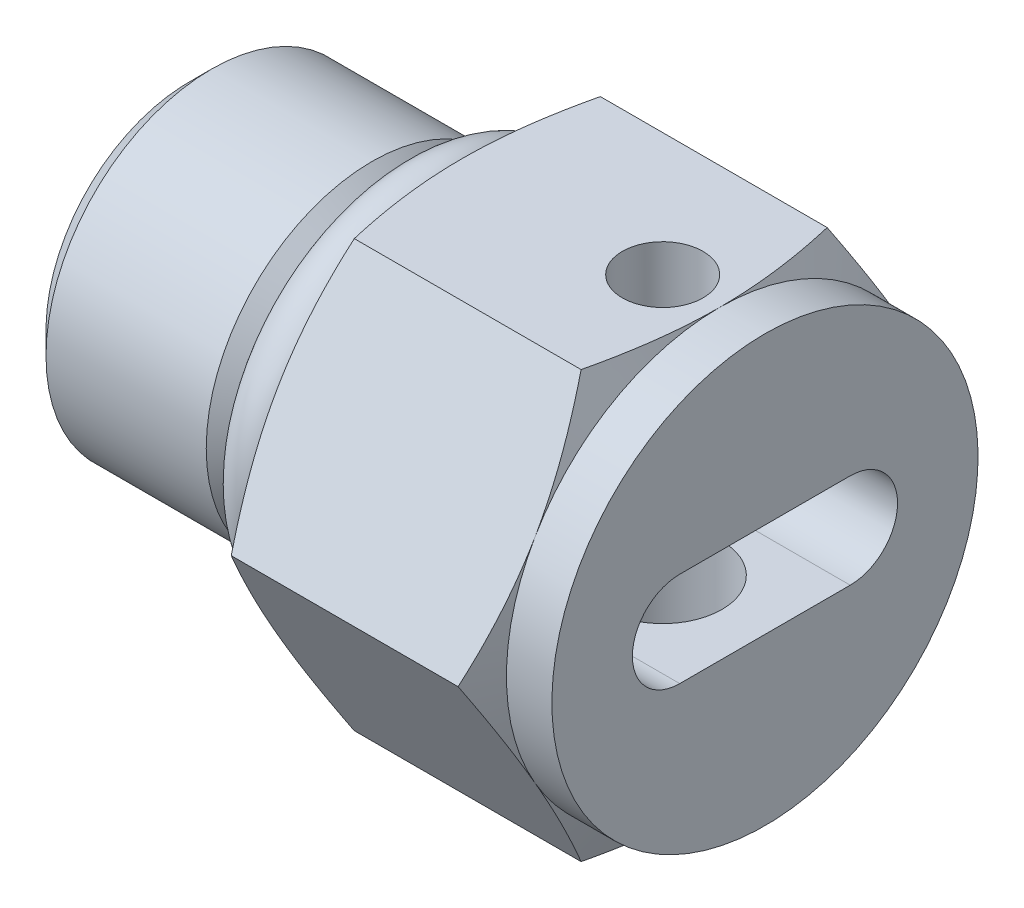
ISO-10303-21;
HEADER;
FILE_DESCRIPTION(('STEP AP214'),'2;1');
FILE_NAME('part.step','',(''),(''),'','','');
FILE_SCHEMA(('AUTOMOTIVE_DESIGN { 1 0 10303 214 1 1 1 1 }'));
ENDSEC;
DATA;
#1=APPLICATION_CONTEXT('core data for automotive mechanical design processes');
#2=APPLICATION_PROTOCOL_DEFINITION('international standard','automotive_design',2000,#1);
#3=PRODUCT_CONTEXT('',#1,'mechanical');
#4=PRODUCT('Part','Part','',(#3));
#5=PRODUCT_RELATED_PRODUCT_CATEGORY('part','',(#4));
#6=PRODUCT_DEFINITION_FORMATION('','',#4);
#7=PRODUCT_DEFINITION_CONTEXT('part definition',#1,'design');
#8=PRODUCT_DEFINITION('design','',#6,#7);
#9=PRODUCT_DEFINITION_SHAPE('','',#8);
#10=(LENGTH_UNIT() NAMED_UNIT(*) SI_UNIT(.MILLI.,.METRE.));
#11=(NAMED_UNIT(*) PLANE_ANGLE_UNIT() SI_UNIT($,.RADIAN.));
#12=(NAMED_UNIT(*) SI_UNIT($,.STERADIAN.) SOLID_ANGLE_UNIT());
#13=UNCERTAINTY_MEASURE_WITH_UNIT(LENGTH_MEASURE(1.E-05),#10,'distance_accuracy_value','');
#14=(GEOMETRIC_REPRESENTATION_CONTEXT(3) GLOBAL_UNCERTAINTY_ASSIGNED_CONTEXT((#13)) GLOBAL_UNIT_ASSIGNED_CONTEXT((#10,
#11,#12)) REPRESENTATION_CONTEXT('',''));
#15=CARTESIAN_POINT('',(0.,0.,0.));
#16=DIRECTION('',(0.,0.,1.));
#17=DIRECTION('',(1.,0.,0.));
#18=AXIS2_PLACEMENT_3D('',#15,#16,#17);
#19=CARTESIAN_POINT('',(9.144,7.14375,0.));
#20=DIRECTION('',(0.,1.,0.));
#21=DIRECTION('',(0.,0.,1.));
#22=AXIS2_PLACEMENT_3D('',#19,#20,#21);
#23=PLANE('',#22);
#24=DIRECTION('',(1.,0.,0.));
#25=VECTOR('',#24,1.);
#26=CARTESIAN_POINT('',(9.144,7.14375,4.12444598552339));
#27=LINE('',#26,#25);
#28=CARTESIAN_POINT('',(17.264663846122,7.14374996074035,4.12444600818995));
#29=VERTEX_POINT('',#28);
#30=CARTESIAN_POINT('',(9.65933616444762,7.14375,4.12444598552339));
#31=VERTEX_POINT('',#30);
#32=EDGE_CURVE('E768',#29,#31,#27,.F.);
#33=ORIENTED_EDGE('',*,*,#32,.F.);
#34=CARTESIAN_POINT('',(17.2646638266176,7.14375,4.12444602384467));
#35=CARTESIAN_POINT('',(17.3435905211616,7.14375,3.78605167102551));
#36=CARTESIAN_POINT('',(17.4156199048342,7.14375,3.44583408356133));
#37=CARTESIAN_POINT('',(17.5424120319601,7.14375,2.7634060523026));
#38=CARTESIAN_POINT('',(17.5972319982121,7.14375,2.42120615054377));
#39=CARTESIAN_POINT('',(17.6643575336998,7.14375,1.90579462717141));
#40=CARTESIAN_POINT('',(17.6842205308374,7.14375,1.73356527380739));
#41=CARTESIAN_POINT('',(17.7185639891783,7.14375,1.38856895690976));
#42=CARTESIAN_POINT('',(17.733044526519,7.14375,1.21580200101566));
#43=CARTESIAN_POINT('',(17.7563806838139,7.14375,0.86930685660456));
#44=CARTESIAN_POINT('',(17.7652173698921,7.14375,0.695577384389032));
#45=CARTESIAN_POINT('',(17.7770376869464,7.14375,0.347900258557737));
#46=CARTESIAN_POINT('',(17.7800206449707,7.14375,0.173952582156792));
#47=CARTESIAN_POINT('',(17.78,7.14375,0.));
#48=B_SPLINE_CURVE_WITH_KNOTS('',3,(#34,#35,#36,#37,#38,#39,#40,#41,#42,#43,#44,#45,#46,#47),
.UNSPECIFIED.,.F.,.F.,(4,2,2,2,2,2,4),(0.,1.04269339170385,2.08188208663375,2.60191817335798,
3.12194690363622,3.64371117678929,4.16553542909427),.UNSPECIFIED.);
#49=CARTESIAN_POINT('',(17.78,7.14375,0.));
#50=VERTEX_POINT('',#49);
#51=EDGE_CURVE('E703',#29,#50,#48,.T.);
#52=ORIENTED_EDGE('',*,*,#51,.T.);
#53=CARTESIAN_POINT('',(17.78,7.14375,0.));
#54=CARTESIAN_POINT('',(17.7800206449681,7.14375,-0.173952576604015));
#55=CARTESIAN_POINT('',(17.7770376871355,7.14375,-0.347900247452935));
#56=CARTESIAN_POINT('',(17.7652173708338,7.14375,-0.695577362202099));
#57=CARTESIAN_POINT('',(17.7563806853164,7.14375,-0.869306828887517));
#58=CARTESIAN_POINT('',(17.7330445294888,7.14375,-1.21580196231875));
#59=CARTESIAN_POINT('',(17.7185639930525,7.14375,-1.38856891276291));
#60=CARTESIAN_POINT('',(17.6842205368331,7.14375,-1.73356521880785));
#61=CARTESIAN_POINT('',(17.6643575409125,7.14375,-1.90579456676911));
#62=CARTESIAN_POINT('',(17.5972320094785,7.14375,-2.42120607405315));
#63=CARTESIAN_POINT('',(17.5424120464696,7.14375,-2.76340596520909));
#64=CARTESIAN_POINT('',(17.4156199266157,7.14375,-3.44583397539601));
#65=CARTESIAN_POINT('',(17.3435905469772,7.14375,-3.7860515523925));
#66=CARTESIAN_POINT('',(17.2646638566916,7.14375,-4.12444589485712));
#67=B_SPLINE_CURVE_WITH_KNOTS('',3,(#53,#54,#55,#56,#57,#58,#59,#60,#61,#62,#63,#64,#65,#66),
.UNSPECIFIED.,.F.,.F.,(4,2,2,2,2,2,4),(0.,0.521824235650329,1.04358849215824,1.56361720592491,
2.08365327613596,3.12284193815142,4.16553529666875),.UNSPECIFIED.);
#68=CARTESIAN_POINT('',(17.264663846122,7.14375,-4.12444594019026));
#69=VERTEX_POINT('',#68);
#70=EDGE_CURVE('E350',#50,#69,#67,.T.);
#71=ORIENTED_EDGE('',*,*,#70,.T.);
#72=DIRECTION('',(1.,0.,0.));
#73=VECTOR('',#72,1.);
#74=CARTESIAN_POINT('',(9.144,7.14375,-4.12444598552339));
#75=LINE('',#74,#73);
#76=CARTESIAN_POINT('',(9.65933616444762,7.14375,-4.12444598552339));
#77=VERTEX_POINT('',#76);
#78=EDGE_CURVE('E330',#77,#69,#75,.T.);
#79=ORIENTED_EDGE('',*,*,#78,.F.);
#80=CARTESIAN_POINT('',(9.65933616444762,7.14375,-4.12444598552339));
#81=CARTESIAN_POINT('',(9.58040947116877,7.14375,-3.78605163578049));
#82=CARTESIAN_POINT('',(9.50838008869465,7.14375,-3.44583405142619));
#83=CARTESIAN_POINT('',(9.38158796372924,7.14375,-2.76340602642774));
#84=CARTESIAN_POINT('',(9.32676799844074,7.14375,-2.42120612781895));
#85=CARTESIAN_POINT('',(9.25964246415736,7.14375,-1.90579460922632));
#86=CARTESIAN_POINT('',(9.2397794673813,7.14375,-1.73356525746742));
#87=CARTESIAN_POINT('',(9.20543600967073,7.14375,-1.38856894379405));
#88=CARTESIAN_POINT('',(9.19095547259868,7.14375,-1.21580198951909));
#89=CARTESIAN_POINT('',(9.16761931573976,7.14375,-0.869306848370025));
#90=CARTESIAN_POINT('',(9.15878262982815,7.14375,-0.695577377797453));
#91=CARTESIAN_POINT('',(9.14696231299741,7.14375,-0.34790025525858));
#92=CARTESIAN_POINT('',(9.14397935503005,7.14375,-0.173952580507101));
#93=CARTESIAN_POINT('',(9.144,7.14375,0.));
#94=B_SPLINE_CURVE_WITH_KNOTS('',3,(#80,#81,#82,#83,#84,#85,#86,#87,#88,#89,#90,#91,#92,#93),
.UNSPECIFIED.,.F.,.F.,(4,2,2,2,2,2,4),(0.,1.04269338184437,2.08188206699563,2.60191814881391,
3.12194687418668,3.64371114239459,4.1655353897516),.UNSPECIFIED.);
#95=CARTESIAN_POINT('',(9.144,7.14375,0.));
#96=VERTEX_POINT('',#95);
#97=EDGE_CURVE('E417',#77,#96,#94,.T.);
#98=ORIENTED_EDGE('',*,*,#97,.T.);
#99=CARTESIAN_POINT('',(9.144,7.14375,0.));
#100=CARTESIAN_POINT('',(9.14397935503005,7.14375,0.1739525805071));
#101=CARTESIAN_POINT('',(9.14696231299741,7.14375,0.347900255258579));
#102=CARTESIAN_POINT('',(9.15878262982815,7.14375,0.695577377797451));
#103=CARTESIAN_POINT('',(9.16761931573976,7.14375,0.869306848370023));
#104=CARTESIAN_POINT('',(9.19095547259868,7.14375,1.21580198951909));
#105=CARTESIAN_POINT('',(9.20543600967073,7.14375,1.38856894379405));
#106=CARTESIAN_POINT('',(9.2397794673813,7.14375,1.73356525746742));
#107=CARTESIAN_POINT('',(9.25964246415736,7.14375,1.90579460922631));
#108=CARTESIAN_POINT('',(9.32676799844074,7.14375,2.42120612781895));
#109=CARTESIAN_POINT('',(9.38158796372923,7.14375,2.76340602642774));
#110=CARTESIAN_POINT('',(9.50838008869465,7.14375,3.44583405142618));
#111=CARTESIAN_POINT('',(9.58040947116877,7.14375,3.78605163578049));
#112=CARTESIAN_POINT('',(9.65933616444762,7.14375,4.12444598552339));
#113=B_SPLINE_CURVE_WITH_KNOTS('',3,(#99,#100,#101,#102,#103,#104,#105,#106,#107,#108,#109,#110,
#111,#112),.UNSPECIFIED.,.F.,.F.,(4,2,2,2,2,2,4),(0.,0.521824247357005,1.04358851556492,
1.56361724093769,2.08365332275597,3.12284200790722,4.16553538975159),.UNSPECIFIED.);
#114=EDGE_CURVE('E427',#96,#31,#113,.T.);
#115=ORIENTED_EDGE('',*,*,#114,.T.);
#116=EDGE_LOOP('',(#33,#52,#71,#79,#98,#115));
#117=FACE_BOUND('',#116,.T.);
#118=CARTESIAN_POINT('',(15.875,7.14375,0.));
#119=DIRECTION('',(0.,-1.,0.));
#120=DIRECTION('',(0.,0.,-1.));
#121=AXIS2_PLACEMENT_3D('',#118,#119,#120);
#122=CIRCLE('',#121,1.35255);
#123=CARTESIAN_POINT('',(15.875,7.14375,-1.35255));
#124=VERTEX_POINT('',#123);
#125=EDGE_CURVE('E802',#124,#124,#122,.T.);
#126=ORIENTED_EDGE('',*,*,#125,.T.);
#127=EDGE_LOOP('',(#126));
#128=FACE_BOUND('',#127,.T.);
#129=ADVANCED_FACE('F59',(#117,#128),#23,.T.);
#130=CARTESIAN_POINT('',(9.144,0.,0.));
#131=DIRECTION('',(1.,0.,0.));
#132=DIRECTION('',(0.,1.,0.));
#133=AXIS2_PLACEMENT_3D('',#130,#131,#132);
#134=PLANE('',#133);
#135=CARTESIAN_POINT('',(9.144,0.,0.));
#136=DIRECTION('',(1.,0.,0.));
#137=DIRECTION('',(0.,1.,0.));
#138=AXIS2_PLACEMENT_3D('',#135,#136,#137);
#139=CIRCLE('',#138,4.572);
#140=CARTESIAN_POINT('',(9.144,4.572,0.));
#141=VERTEX_POINT('',#140);
#142=EDGE_CURVE('E680',#141,#141,#139,.F.);
#143=ORIENTED_EDGE('',*,*,#142,.F.);
#144=EDGE_LOOP('',(#143));
#145=FACE_BOUND('',#144,.T.);
#146=CARTESIAN_POINT('',(9.144,0.,0.));
#147=DIRECTION('',(1.,0.,0.));
#148=DIRECTION('',(0.,0.,-1.));
#149=AXIS2_PLACEMENT_3D('',#146,#147,#148);
#150=CIRCLE('',#149,7.14375);
#151=CARTESIAN_POINT('',(9.144,3.571875,6.18666897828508));
#152=VERTEX_POINT('',#151);
#153=EDGE_CURVE('E299',#152,#96,#150,.F.);
#154=ORIENTED_EDGE('',*,*,#153,.T.);
#155=CARTESIAN_POINT('',(9.144,0.,0.));
#156=DIRECTION('',(1.,0.,0.));
#157=DIRECTION('',(0.,0.,-1.));
#158=AXIS2_PLACEMENT_3D('',#155,#156,#157);
#159=CIRCLE('',#158,7.14375);
#160=CARTESIAN_POINT('',(9.144,3.571875,-6.18666897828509));
#161=VERTEX_POINT('',#160);
#162=EDGE_CURVE('E428',#96,#161,#159,.F.);
#163=ORIENTED_EDGE('',*,*,#162,.T.);
#164=CARTESIAN_POINT('',(9.144,0.,0.));
#165=DIRECTION('',(1.,0.,0.));
#166=DIRECTION('',(0.,0.,-1.));
#167=AXIS2_PLACEMENT_3D('',#164,#165,#166);
#168=CIRCLE('',#167,7.14375);
#169=CARTESIAN_POINT('',(9.144,-3.57187500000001,-6.18666897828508));
#170=VERTEX_POINT('',#169);
#171=EDGE_CURVE('E823',#161,#170,#168,.F.);
#172=ORIENTED_EDGE('',*,*,#171,.T.);
#173=CARTESIAN_POINT('',(9.144,0.,0.));
#174=DIRECTION('',(1.,0.,0.));
#175=DIRECTION('',(0.,0.,-1.));
#176=AXIS2_PLACEMENT_3D('',#173,#174,#175);
#177=CIRCLE('',#176,7.14375);
#178=CARTESIAN_POINT('',(9.144,-7.14375,0.));
#179=VERTEX_POINT('',#178);
#180=EDGE_CURVE('E821',#170,#179,#177,.F.);
#181=ORIENTED_EDGE('',*,*,#180,.T.);
#182=CARTESIAN_POINT('',(9.144,0.,0.));
#183=DIRECTION('',(1.,0.,0.));
#184=DIRECTION('',(0.,0.,-1.));
#185=AXIS2_PLACEMENT_3D('',#182,#183,#184);
#186=CIRCLE('',#185,7.14375);
#187=CARTESIAN_POINT('',(9.144,-3.571875,6.18666897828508));
#188=VERTEX_POINT('',#187);
#189=EDGE_CURVE('E824',#179,#188,#186,.F.);
#190=ORIENTED_EDGE('',*,*,#189,.T.);
#191=CARTESIAN_POINT('',(9.144,0.,0.));
#192=DIRECTION('',(1.,0.,0.));
#193=DIRECTION('',(0.,0.,-1.));
#194=AXIS2_PLACEMENT_3D('',#191,#192,#193);
#195=CIRCLE('',#194,7.14375);
#196=EDGE_CURVE('E1107',#188,#152,#195,.F.);
#197=ORIENTED_EDGE('',*,*,#196,.T.);
#198=EDGE_LOOP('',(#154,#163,#172,#181,#190,#197));
#199=FACE_BOUND('',#198,.T.);
#200=ADVANCED_FACE('F602',(#145,#199),#134,.F.);
#201=CARTESIAN_POINT('',(9.144,0.,0.));
#202=DIRECTION('',(1.,0.,0.));
#203=DIRECTION('',(0.,0.,-1.));
#204=AXIS2_PLACEMENT_3D('',#201,#202,#203);
#205=CONICAL_SURFACE('',#204,7.14375,1.13446401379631);
#206=ORIENTED_EDGE('',*,*,#153,.F.);
#207=CARTESIAN_POINT('',(9.65933616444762,7.14375,4.12444598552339));
#208=CARTESIAN_POINT('',(9.58040947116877,6.85069189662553,4.29364316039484));
#209=CARTESIAN_POINT('',(9.50838008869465,6.55605482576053,4.46375195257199));
#210=CARTESIAN_POINT('',(9.38158796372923,5.96505481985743,4.80496596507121));
#211=CARTESIAN_POINT('',(9.32676799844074,5.66870101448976,4.97606591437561));
#212=CARTESIAN_POINT('',(9.25964246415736,5.22234154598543,5.23377167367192));
#213=CARTESIAN_POINT('',(9.2397794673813,5.0731865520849,5.31988634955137));
#214=CARTESIAN_POINT('',(9.20543600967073,4.77441098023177,5.49238450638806));
#215=CARTESIAN_POINT('',(9.19095547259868,4.62479040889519,5.57876798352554));
#216=CARTESIAN_POINT('',(9.16761931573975,4.32471681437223,5.75201555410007));
#217=CARTESIAN_POINT('',(9.15878262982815,4.17426267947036,5.83888028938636));
#218=CARTESIAN_POINT('',(9.14696231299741,3.87316545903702,6.01271885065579));
#219=CARTESIAN_POINT('',(9.14397935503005,3.72252235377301,6.09969268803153));
#220=CARTESIAN_POINT('',(9.144,3.571875,6.18666897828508));
#221=B_SPLINE_CURVE_WITH_KNOTS('',3,(#207,#208,#209,#210,#211,#212,#213,#214,#215,#216,#217,
#218,#219,#220),.UNSPECIFIED.,.F.,.F.,(4,2,2,2,2,2,4),(0.,1.04269338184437,2.08188206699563,
2.60191814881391,3.12194687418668,3.64371114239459,4.1655353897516),.UNSPECIFIED.);
#222=EDGE_CURVE('E750',#31,#152,#221,.T.);
#223=ORIENTED_EDGE('',*,*,#222,.F.);
#224=ORIENTED_EDGE('',*,*,#114,.F.);
#225=EDGE_LOOP('',(#206,#223,#224));
#226=FACE_BOUND('',#225,.T.);
#227=ADVANCED_FACE('F652',(#226),#205,.T.);
#228=CARTESIAN_POINT('',(9.144,0.,0.));
#229=DIRECTION('',(1.,0.,0.));
#230=DIRECTION('',(0.,0.,-1.));
#231=AXIS2_PLACEMENT_3D('',#228,#229,#230);
#232=CONICAL_SURFACE('',#231,7.14375,1.13446401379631);
#233=ORIENTED_EDGE('',*,*,#196,.F.);
#234=CARTESIAN_POINT('',(9.65933616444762,0.,8.24889197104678));
#235=CARTESIAN_POINT('',(9.58040947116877,-0.293058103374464,8.07969479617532));
#236=CARTESIAN_POINT('',(9.50838008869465,-0.587695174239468,7.90958600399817));
#237=CARTESIAN_POINT('',(9.38158796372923,-1.17869518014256,7.56837199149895));
#238=CARTESIAN_POINT('',(9.32676799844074,-1.47504898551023,7.39727204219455));
#239=CARTESIAN_POINT('',(9.25964246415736,-1.92140845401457,7.13956628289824));
#240=CARTESIAN_POINT('',(9.2397794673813,-2.0705634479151,7.05345160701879));
#241=CARTESIAN_POINT('',(9.20543600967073,-2.36933901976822,6.88095345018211));
#242=CARTESIAN_POINT('',(9.19095547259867,-2.51895959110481,6.79456997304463));
#243=CARTESIAN_POINT('',(9.16761931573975,-2.81903318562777,6.62132240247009));
#244=CARTESIAN_POINT('',(9.15878262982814,-2.96948732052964,6.53445766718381));
#245=CARTESIAN_POINT('',(9.14696231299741,-3.27058454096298,6.36061910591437));
#246=CARTESIAN_POINT('',(9.14397935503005,-3.42122764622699,6.27364526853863));
#247=CARTESIAN_POINT('',(9.144,-3.571875,6.18666897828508));
#248=B_SPLINE_CURVE_WITH_KNOTS('',3,(#234,#235,#236,#237,#238,#239,#240,#241,#242,#243,#244,
#245,#246,#247),.UNSPECIFIED.,.F.,.F.,(4,2,2,2,2,2,4),(0.,1.04269338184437,2.08188206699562,
2.60191814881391,3.12194687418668,3.64371114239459,4.16553538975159),.UNSPECIFIED.);
#249=CARTESIAN_POINT('',(9.65933616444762,0.,8.24889197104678));
#250=VERTEX_POINT('',#249);
#251=EDGE_CURVE('E751',#250,#188,#248,.T.);
#252=ORIENTED_EDGE('',*,*,#251,.F.);
#253=CARTESIAN_POINT('',(9.144,3.571875,6.18666897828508));
#254=CARTESIAN_POINT('',(9.14397935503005,3.42122764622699,6.27364526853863));
#255=CARTESIAN_POINT('',(9.14696231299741,3.27058454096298,6.36061910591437));
#256=CARTESIAN_POINT('',(9.15878262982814,2.96948732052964,6.53445766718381));
#257=CARTESIAN_POINT('',(9.16761931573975,2.81903318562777,6.62132240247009));
#258=CARTESIAN_POINT('',(9.19095547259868,2.51895959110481,6.79456997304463));
#259=CARTESIAN_POINT('',(9.20543600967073,2.36933901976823,6.88095345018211));
#260=CARTESIAN_POINT('',(9.2397794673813,2.0705634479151,7.05345160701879));
#261=CARTESIAN_POINT('',(9.25964246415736,1.92140845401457,7.13956628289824));
#262=CARTESIAN_POINT('',(9.32676799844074,1.47504898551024,7.39727204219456));
#263=CARTESIAN_POINT('',(9.38158796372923,1.17869518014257,7.56837199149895));
#264=CARTESIAN_POINT('',(9.50838008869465,0.587695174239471,7.90958600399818));
#265=CARTESIAN_POINT('',(9.58040947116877,0.293058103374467,8.07969479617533));
#266=CARTESIAN_POINT('',(9.65933616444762,0.,8.24889197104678));
#267=B_SPLINE_CURVE_WITH_KNOTS('',3,(#253,#254,#255,#256,#257,#258,#259,#260,#261,#262,#263,
#264,#265,#266),.UNSPECIFIED.,.F.,.F.,(4,2,2,2,2,2,4),(0.,0.521824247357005,1.04358851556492,
1.56361724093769,2.08365332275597,3.12284200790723,4.16553538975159),.UNSPECIFIED.);
#268=EDGE_CURVE('E742',#152,#250,#267,.T.);
#269=ORIENTED_EDGE('',*,*,#268,.F.);
#270=EDGE_LOOP('',(#233,#252,#269));
#271=FACE_BOUND('',#270,.T.);
#272=ADVANCED_FACE('F480',(#271),#232,.T.);
#273=CARTESIAN_POINT('',(9.144,0.,0.));
#274=DIRECTION('',(1.,0.,0.));
#275=DIRECTION('',(0.,0.,-1.));
#276=AXIS2_PLACEMENT_3D('',#273,#274,#275);
#277=CONICAL_SURFACE('',#276,7.14375,1.13446401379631);
#278=CARTESIAN_POINT('',(9.144,-3.571875,6.18666897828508));
#279=CARTESIAN_POINT('',(9.14397935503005,-3.722522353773,6.09969268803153));
#280=CARTESIAN_POINT('',(9.14696231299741,-3.87316545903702,6.01271885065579));
#281=CARTESIAN_POINT('',(9.15878262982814,-4.17426267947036,5.83888028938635));
#282=CARTESIAN_POINT('',(9.16761931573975,-4.32471681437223,5.75201555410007));
#283=CARTESIAN_POINT('',(9.19095547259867,-4.62479040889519,5.57876798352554));
#284=CARTESIAN_POINT('',(9.20543600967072,-4.77441098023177,5.49238450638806));
#285=CARTESIAN_POINT('',(9.2397794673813,-5.07318655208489,5.31988634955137));
#286=CARTESIAN_POINT('',(9.25964246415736,-5.22234154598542,5.23377167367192));
#287=CARTESIAN_POINT('',(9.32676799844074,-5.66870101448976,4.97606591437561));
#288=CARTESIAN_POINT('',(9.38158796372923,-5.96505481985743,4.80496596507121));
#289=CARTESIAN_POINT('',(9.50838008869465,-6.55605482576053,4.46375195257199));
#290=CARTESIAN_POINT('',(9.58040947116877,-6.85069189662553,4.29364316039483));
#291=CARTESIAN_POINT('',(9.65933616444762,-7.14375,4.12444598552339));
#292=B_SPLINE_CURVE_WITH_KNOTS('',3,(#278,#279,#280,#281,#282,#283,#284,#285,#286,#287,#288,
#289,#290,#291),.UNSPECIFIED.,.F.,.F.,(4,2,2,2,2,2,4),(0.,0.521824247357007,1.04358851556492,
1.56361724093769,2.08365332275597,3.12284200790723,4.1655353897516),.UNSPECIFIED.);
#293=CARTESIAN_POINT('',(9.65933616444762,-7.14375,4.12444598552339));
#294=VERTEX_POINT('',#293);
#295=EDGE_CURVE('E485',#188,#294,#292,.T.);
#296=ORIENTED_EDGE('',*,*,#295,.F.);
#297=ORIENTED_EDGE('',*,*,#189,.F.);
#298=CARTESIAN_POINT('',(9.65933616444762,-7.14374999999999,4.12444598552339));
#299=CARTESIAN_POINT('',(9.58040947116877,-7.14374999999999,3.78605163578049));
#300=CARTESIAN_POINT('',(9.50838008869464,-7.14374999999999,3.44583405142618));
#301=CARTESIAN_POINT('',(9.38158796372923,-7.14374999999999,2.76340602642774));
#302=CARTESIAN_POINT('',(9.32676799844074,-7.14374999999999,2.42120612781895));
#303=CARTESIAN_POINT('',(9.25964246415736,-7.14374999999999,1.90579460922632));
#304=CARTESIAN_POINT('',(9.2397794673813,-7.14374999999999,1.73356525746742));
#305=CARTESIAN_POINT('',(9.20543600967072,-7.14374999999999,1.38856894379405));
#306=CARTESIAN_POINT('',(9.19095547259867,-7.14375,1.21580198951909));
#307=CARTESIAN_POINT('',(9.16761931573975,-7.14375,0.869306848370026));
#308=CARTESIAN_POINT('',(9.15878262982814,-7.14375,0.695577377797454));
#309=CARTESIAN_POINT('',(9.14696231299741,-7.14375,0.347900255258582));
#310=CARTESIAN_POINT('',(9.14397935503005,-7.14375,0.173952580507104));
#311=CARTESIAN_POINT('',(9.144,-7.14375,0.));
#312=B_SPLINE_CURVE_WITH_KNOTS('',3,(#298,#299,#300,#301,#302,#303,#304,#305,#306,#307,#308,
#309,#310,#311),.UNSPECIFIED.,.F.,.F.,(4,2,2,2,2,2,4),(0.,1.04269338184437,2.08188206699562,
2.60191814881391,3.12194687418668,3.64371114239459,4.16553538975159),.UNSPECIFIED.);
#313=EDGE_CURVE('E493',#294,#179,#312,.T.);
#314=ORIENTED_EDGE('',*,*,#313,.F.);
#315=EDGE_LOOP('',(#296,#297,#314));
#316=FACE_BOUND('',#315,.T.);
#317=ADVANCED_FACE('F474',(#316),#277,.T.);
#318=CARTESIAN_POINT('',(9.144,0.,0.));
#319=DIRECTION('',(1.,0.,0.));
#320=DIRECTION('',(0.,0.,-1.));
#321=AXIS2_PLACEMENT_3D('',#318,#319,#320);
#322=CONICAL_SURFACE('',#321,7.14375,1.13446401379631);
#323=CARTESIAN_POINT('',(9.144,-7.14375,0.));
#324=CARTESIAN_POINT('',(9.14397935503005,-7.14375,-0.1739525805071));
#325=CARTESIAN_POINT('',(9.14696231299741,-7.14375,-0.347900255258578));
#326=CARTESIAN_POINT('',(9.15878262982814,-7.14375,-0.69557737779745));
#327=CARTESIAN_POINT('',(9.16761931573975,-7.14375,-0.869306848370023));
#328=CARTESIAN_POINT('',(9.19095547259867,-7.14375,-1.21580198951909));
#329=CARTESIAN_POINT('',(9.20543600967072,-7.14375,-1.38856894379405));
#330=CARTESIAN_POINT('',(9.2397794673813,-7.14375,-1.73356525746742));
#331=CARTESIAN_POINT('',(9.25964246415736,-7.14375,-1.90579460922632));
#332=CARTESIAN_POINT('',(9.32676799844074,-7.14375,-2.42120612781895));
#333=CARTESIAN_POINT('',(9.38158796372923,-7.14375,-2.76340602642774));
#334=CARTESIAN_POINT('',(9.50838008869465,-7.14375,-3.44583405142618));
#335=CARTESIAN_POINT('',(9.58040947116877,-7.14375,-3.78605163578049));
#336=CARTESIAN_POINT('',(9.65933616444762,-7.14375,-4.12444598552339));
#337=B_SPLINE_CURVE_WITH_KNOTS('',3,(#323,#324,#325,#326,#327,#328,#329,#330,#331,#332,#333,
#334,#335,#336),.UNSPECIFIED.,.F.,.F.,(4,2,2,2,2,2,4),(0.,0.521824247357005,1.04358851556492,
1.56361724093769,2.08365332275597,3.12284200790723,4.1655353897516),.UNSPECIFIED.);
#338=CARTESIAN_POINT('',(9.65933616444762,-7.14375,-4.12444598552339));
#339=VERTEX_POINT('',#338);
#340=EDGE_CURVE('E463',#179,#339,#337,.T.);
#341=ORIENTED_EDGE('',*,*,#340,.F.);
#342=ORIENTED_EDGE('',*,*,#180,.F.);
#343=CARTESIAN_POINT('',(9.65933616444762,-7.14375,-4.12444598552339));
#344=CARTESIAN_POINT('',(9.58040947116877,-6.85069189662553,-4.29364316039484));
#345=CARTESIAN_POINT('',(9.50838008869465,-6.55605482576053,-4.46375195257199));
#346=CARTESIAN_POINT('',(9.38158796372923,-5.96505481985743,-4.80496596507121));
#347=CARTESIAN_POINT('',(9.32676799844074,-5.66870101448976,-4.97606591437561));
#348=CARTESIAN_POINT('',(9.25964246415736,-5.22234154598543,-5.23377167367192));
#349=CARTESIAN_POINT('',(9.2397794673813,-5.0731865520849,-5.31988634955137));
#350=CARTESIAN_POINT('',(9.20543600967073,-4.77441098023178,-5.49238450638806));
#351=CARTESIAN_POINT('',(9.19095547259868,-4.6247904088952,-5.57876798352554));
#352=CARTESIAN_POINT('',(9.16761931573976,-4.32471681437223,-5.75201555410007));
#353=CARTESIAN_POINT('',(9.15878262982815,-4.17426267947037,-5.83888028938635));
#354=CARTESIAN_POINT('',(9.14696231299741,-3.87316545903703,-6.01271885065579));
#355=CARTESIAN_POINT('',(9.14397935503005,-3.72252235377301,-6.09969268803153));
#356=CARTESIAN_POINT('',(9.144,-3.57187500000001,-6.18666897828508));
#357=B_SPLINE_CURVE_WITH_KNOTS('',3,(#343,#344,#345,#346,#347,#348,#349,#350,#351,#352,#353,
#354,#355,#356),.UNSPECIFIED.,.F.,.F.,(4,2,2,2,2,2,4),(0.,1.04269338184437,2.08188206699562,
2.6019181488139,3.12194687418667,3.64371114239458,4.16553538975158),.UNSPECIFIED.);
#358=EDGE_CURVE('E453',#339,#170,#357,.T.);
#359=ORIENTED_EDGE('',*,*,#358,.F.);
#360=EDGE_LOOP('',(#341,#342,#359));
#361=FACE_BOUND('',#360,.T.);
#362=ADVANCED_FACE('F470',(#361),#322,.T.);
#363=CARTESIAN_POINT('',(9.144,0.,0.));
#364=DIRECTION('',(1.,0.,0.));
#365=DIRECTION('',(0.,0.,-1.));
#366=AXIS2_PLACEMENT_3D('',#363,#364,#365);
#367=CONICAL_SURFACE('',#366,7.14375,1.13446401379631);
#368=ORIENTED_EDGE('',*,*,#171,.F.);
#369=CARTESIAN_POINT('',(9.65933616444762,0.,-8.24889197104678));
#370=CARTESIAN_POINT('',(9.58040947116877,0.293058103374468,-8.07969479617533));
#371=CARTESIAN_POINT('',(9.50838008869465,0.587695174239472,-7.90958600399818));
#372=CARTESIAN_POINT('',(9.38158796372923,1.17869518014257,-7.56837199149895));
#373=CARTESIAN_POINT('',(9.32676799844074,1.47504898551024,-7.39727204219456));
#374=CARTESIAN_POINT('',(9.25964246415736,1.92140845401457,-7.13956628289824));
#375=CARTESIAN_POINT('',(9.2397794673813,2.0705634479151,-7.0534516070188));
#376=CARTESIAN_POINT('',(9.20543600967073,2.36933901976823,-6.88095345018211));
#377=CARTESIAN_POINT('',(9.19095547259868,2.51895959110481,-6.79456997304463));
#378=CARTESIAN_POINT('',(9.16761931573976,2.81903318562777,-6.6213224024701));
#379=CARTESIAN_POINT('',(9.15878262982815,2.96948732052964,-6.53445766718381));
#380=CARTESIAN_POINT('',(9.14696231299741,3.27058454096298,-6.36061910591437));
#381=CARTESIAN_POINT('',(9.14397935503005,3.42122764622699,-6.27364526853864));
#382=CARTESIAN_POINT('',(9.144,3.571875,-6.18666897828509));
#383=B_SPLINE_CURVE_WITH_KNOTS('',3,(#369,#370,#371,#372,#373,#374,#375,#376,#377,#378,#379,
#380,#381,#382),.UNSPECIFIED.,.F.,.F.,(4,2,2,2,2,2,4),(0.,1.04269338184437,2.08188206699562,
2.60191814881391,3.12194687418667,3.64371114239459,4.16553538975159),.UNSPECIFIED.);
#384=CARTESIAN_POINT('',(9.65933616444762,0.,-8.24889197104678));
#385=VERTEX_POINT('',#384);
#386=EDGE_CURVE('E397',#385,#161,#383,.T.);
#387=ORIENTED_EDGE('',*,*,#386,.F.);
#388=CARTESIAN_POINT('',(9.144,-3.57187500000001,-6.18666897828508));
#389=CARTESIAN_POINT('',(9.14397935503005,-3.421227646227,-6.27364526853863));
#390=CARTESIAN_POINT('',(9.14696231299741,-3.27058454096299,-6.36061910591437));
#391=CARTESIAN_POINT('',(9.15878262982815,-2.96948732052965,-6.53445766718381));
#392=CARTESIAN_POINT('',(9.16761931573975,-2.81903318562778,-6.62132240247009));
#393=CARTESIAN_POINT('',(9.19095547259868,-2.51895959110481,-6.79456997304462));
#394=CARTESIAN_POINT('',(9.20543600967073,-2.36933901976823,-6.88095345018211));
#395=CARTESIAN_POINT('',(9.2397794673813,-2.07056344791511,-7.05345160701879));
#396=CARTESIAN_POINT('',(9.25964246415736,-1.92140845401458,-7.13956628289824));
#397=CARTESIAN_POINT('',(9.32676799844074,-1.47504898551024,-7.39727204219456));
#398=CARTESIAN_POINT('',(9.38158796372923,-1.17869518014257,-7.56837199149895));
#399=CARTESIAN_POINT('',(9.50838008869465,-0.587695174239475,-7.90958600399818));
#400=CARTESIAN_POINT('',(9.58040947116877,-0.29305810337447,-8.07969479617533));
#401=CARTESIAN_POINT('',(9.65933616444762,0.,-8.24889197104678));
#402=B_SPLINE_CURVE_WITH_KNOTS('',3,(#388,#389,#390,#391,#392,#393,#394,#395,#396,#397,#398,
#399,#400,#401),.UNSPECIFIED.,.F.,.F.,(4,2,2,2,2,2,4),(0.,0.521824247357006,1.04358851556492,
1.56361724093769,2.08365332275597,3.12284200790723,4.1655353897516),.UNSPECIFIED.);
#403=EDGE_CURVE('E445',#170,#385,#402,.T.);
#404=ORIENTED_EDGE('',*,*,#403,.F.);
#405=EDGE_LOOP('',(#368,#387,#404));
#406=FACE_BOUND('',#405,.T.);
#407=ADVANCED_FACE('F410',(#406),#367,.T.);
#408=CARTESIAN_POINT('',(9.144,0.,0.));
#409=DIRECTION('',(1.,0.,0.));
#410=DIRECTION('',(0.,0.,-1.));
#411=AXIS2_PLACEMENT_3D('',#408,#409,#410);
#412=CONICAL_SURFACE('',#411,7.14375,1.13446401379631);
#413=ORIENTED_EDGE('',*,*,#162,.F.);
#414=ORIENTED_EDGE('',*,*,#97,.F.);
#415=CARTESIAN_POINT('',(9.144,3.571875,-6.18666897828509));
#416=CARTESIAN_POINT('',(9.14397935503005,3.72252235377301,-6.09969268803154));
#417=CARTESIAN_POINT('',(9.14696231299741,3.87316545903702,-6.0127188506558));
#418=CARTESIAN_POINT('',(9.15878262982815,4.17426267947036,-5.83888028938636));
#419=CARTESIAN_POINT('',(9.16761931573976,4.32471681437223,-5.75201555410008));
#420=CARTESIAN_POINT('',(9.19095547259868,4.62479040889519,-5.57876798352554));
#421=CARTESIAN_POINT('',(9.20543600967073,4.77441098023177,-5.49238450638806));
#422=CARTESIAN_POINT('',(9.2397794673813,5.0731865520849,-5.31988634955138));
#423=CARTESIAN_POINT('',(9.25964246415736,5.22234154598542,-5.23377167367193));
#424=CARTESIAN_POINT('',(9.32676799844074,5.66870101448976,-4.97606591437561));
#425=CARTESIAN_POINT('',(9.38158796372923,5.96505481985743,-4.80496596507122));
#426=CARTESIAN_POINT('',(9.50838008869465,6.55605482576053,-4.463751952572));
#427=CARTESIAN_POINT('',(9.58040947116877,6.85069189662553,-4.29364316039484));
#428=CARTESIAN_POINT('',(9.65933616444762,7.14375,-4.1244459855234));
#429=B_SPLINE_CURVE_WITH_KNOTS('',3,(#415,#416,#417,#418,#419,#420,#421,#422,#423,#424,#425,
#426,#427,#428),.UNSPECIFIED.,.F.,.F.,(4,2,2,2,2,2,4),(0.,0.521824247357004,1.04358851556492,
1.56361724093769,2.08365332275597,3.12284200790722,4.16553538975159),.UNSPECIFIED.);
#430=EDGE_CURVE('E388',#161,#77,#429,.T.);
#431=ORIENTED_EDGE('',*,*,#430,.F.);
#432=EDGE_LOOP('',(#413,#414,#431));
#433=FACE_BOUND('',#432,.T.);
#434=ADVANCED_FACE('F406',(#433),#412,.T.);
#435=CARTESIAN_POINT('',(9.144,0.,8.24889197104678));
#436=DIRECTION('',(0.,0.5,0.866025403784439));
#437=DIRECTION('',(0.,-0.866025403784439,0.5));
#438=AXIS2_PLACEMENT_3D('',#435,#436,#437);
#439=PLANE('',#438);
#440=DIRECTION('',(1.,0.,0.));
#441=VECTOR('',#440,1.);
#442=CARTESIAN_POINT('',(9.144,0.,8.24889197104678));
#443=LINE('',#442,#441);
#444=CARTESIAN_POINT('',(17.2646638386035,-1.1333017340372E-08,8.24889196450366));
#445=VERTEX_POINT('',#444);
#446=EDGE_CURVE('E749',#445,#250,#443,.F.);
#447=ORIENTED_EDGE('',*,*,#446,.F.);
#448=CARTESIAN_POINT('',(17.2646638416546,2.26660453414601E-08,8.24889195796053));
#449=CARTESIAN_POINT('',(17.3435905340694,0.293058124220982,8.07969478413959));
#450=CARTESIAN_POINT('',(17.415619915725,0.587695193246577,7.90958599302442));
#451=CARTESIAN_POINT('',(17.5424120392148,1.17869519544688,7.56837198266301));
#452=CARTESIAN_POINT('',(17.5972320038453,1.47504899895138,7.39727203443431));
#453=CARTESIAN_POINT('',(17.6643575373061,1.92140846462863,7.13956627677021));
#454=CARTESIAN_POINT('',(17.6842205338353,2.07056345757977,7.05345160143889));
#455=CARTESIAN_POINT('',(17.7185639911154,2.36933902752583,6.88095344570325));
#456=CARTESIAN_POINT('',(17.7330445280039,2.51895959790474,6.79456996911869));
#457=CARTESIAN_POINT('',(17.7563806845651,2.81903319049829,6.6213223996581));
#458=CARTESIAN_POINT('',(17.7652173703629,2.96948732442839,6.53445766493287));
#459=CARTESIAN_POINT('',(17.777037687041,3.27058454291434,6.36061910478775));
#460=CARTESIAN_POINT('',(17.7800206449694,3.42122764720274,6.27364526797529));
#461=CARTESIAN_POINT('',(17.78,3.571875,6.18666897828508));
#462=B_SPLINE_CURVE_WITH_KNOTS('',3,(#448,#449,#450,#451,#452,#453,#454,#455,#456,#457,#458,
#459,#460,#461),.UNSPECIFIED.,.F.,.F.,(4,2,2,2,2,2,4),(0.,1.04269337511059,2.08188205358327,
2.60191813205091,3.12194685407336,3.64371111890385,4.16553536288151),.UNSPECIFIED.);
#463=CARTESIAN_POINT('',(17.78,3.571875,6.18666897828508));
#464=VERTEX_POINT('',#463);
#465=EDGE_CURVE('E727',#445,#464,#462,.T.);
#466=ORIENTED_EDGE('',*,*,#465,.T.);
#467=CARTESIAN_POINT('',(17.78,3.571875,6.18666897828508));
#468=CARTESIAN_POINT('',(17.7800206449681,3.72252235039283,6.09969268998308));
#469=CARTESIAN_POINT('',(17.7770376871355,3.87316545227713,6.01271885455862));
#470=CARTESIAN_POINT('',(17.7652173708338,4.17426266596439,5.83888029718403));
#471=CARTESIAN_POINT('',(17.7563806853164,4.32471679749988,5.75201556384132));
#472=CARTESIAN_POINT('',(17.7330445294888,4.62479038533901,5.57876799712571));
#473=CARTESIAN_POINT('',(17.7185639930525,4.77441095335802,5.49238452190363));
#474=CARTESIAN_POINT('',(17.6842205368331,5.07318651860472,5.31988636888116));
#475=CARTESIAN_POINT('',(17.6643575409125,5.22234150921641,5.23377169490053));
#476=CARTESIAN_POINT('',(17.5972320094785,5.66870096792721,4.97606594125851));
#477=CARTESIAN_POINT('',(17.5424120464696,5.96505476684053,4.80496599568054));
#478=CARTESIAN_POINT('',(17.4156199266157,6.55605475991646,4.46375199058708));
#479=CARTESIAN_POINT('',(17.3435905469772,6.85069182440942,4.29364320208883));
#480=CARTESIAN_POINT('',(17.2646638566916,7.14374992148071,4.12444603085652));
#481=B_SPLINE_CURVE_WITH_KNOTS('',3,(#467,#468,#469,#470,#471,#472,#473,#474,#475,#476,#477,
#478,#479,#480),.UNSPECIFIED.,.F.,.F.,(4,2,2,2,2,2,4),(0.,0.521824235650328,1.04358849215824,
1.56361720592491,2.08365327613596,3.12284193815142,4.16553529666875),.UNSPECIFIED.);
#482=EDGE_CURVE('E349',#464,#29,#481,.T.);
#483=ORIENTED_EDGE('',*,*,#482,.T.);
#484=ORIENTED_EDGE('',*,*,#32,.T.);
#485=ORIENTED_EDGE('',*,*,#222,.T.);
#486=ORIENTED_EDGE('',*,*,#268,.T.);
#487=EDGE_LOOP('',(#447,#466,#483,#484,#485,#486));
#488=FACE_BOUND('',#487,.T.);
#489=ADVANCED_FACE('F409',(#488),#439,.T.);
#490=CARTESIAN_POINT('',(9.144,-7.14375,4.12444598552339));
#491=DIRECTION('',(0.,-0.5,0.866025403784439));
#492=DIRECTION('',(0.,-0.866025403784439,-0.5));
#493=AXIS2_PLACEMENT_3D('',#490,#491,#492);
#494=PLANE('',#493);
#495=DIRECTION('',(1.,0.,0.));
#496=VECTOR('',#495,1.);
#497=CARTESIAN_POINT('',(9.144,-7.14374999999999,4.12444598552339));
#498=LINE('',#497,#496);
#499=CARTESIAN_POINT('',(17.264663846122,-7.14374999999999,4.12444594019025));
#500=VERTEX_POINT('',#499);
#501=EDGE_CURVE('E501',#500,#294,#498,.F.);
#502=ORIENTED_EDGE('',*,*,#501,.F.);
#503=CARTESIAN_POINT('',(17.2646638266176,-7.1437500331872,4.12444596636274));
#504=CARTESIAN_POINT('',(17.3435905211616,-6.85069192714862,4.29364314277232));
#505=CARTESIAN_POINT('',(17.4156199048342,-6.55605485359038,4.46375193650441));
#506=CARTESIAN_POINT('',(17.5424120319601,-5.96505484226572,4.80496595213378));
#507=CARTESIAN_POINT('',(17.5972319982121,-5.66870103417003,4.9760659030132));
#508=CARTESIAN_POINT('',(17.6643575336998,-5.22234156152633,5.23377166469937));
#509=CARTESIAN_POINT('',(17.6842205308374,-5.07318656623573,5.31988634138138));
#510=CARTESIAN_POINT('',(17.7185639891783,-4.77441099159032,5.4923844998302));
#511=CARTESIAN_POINT('',(17.733044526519,-4.62479041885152,5.57876797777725));
#512=CARTESIAN_POINT('',(17.7563806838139,-4.32471682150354,5.7520155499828));
#513=CARTESIAN_POINT('',(17.7652173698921,-4.17426268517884,5.83888028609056));
#514=CARTESIAN_POINT('',(17.7770376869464,-3.87316546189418,6.01271884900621));
#515=CARTESIAN_POINT('',(17.7800206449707,-3.72252235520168,6.09969268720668));
#516=CARTESIAN_POINT('',(17.78,-3.571875,6.18666897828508));
#517=B_SPLINE_CURVE_WITH_KNOTS('',3,(#503,#504,#505,#506,#507,#508,#509,#510,#511,#512,#513,
#514,#515,#516),.UNSPECIFIED.,.F.,.F.,(4,2,2,2,2,2,4),(0.,1.04269339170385,2.08188208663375,
2.60191817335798,3.12194690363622,3.64371117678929,4.16553542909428),.UNSPECIFIED.);
#518=CARTESIAN_POINT('',(17.78,-3.571875,6.18666897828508));
#519=VERTEX_POINT('',#518);
#520=EDGE_CURVE('E533',#500,#519,#517,.T.);
#521=ORIENTED_EDGE('',*,*,#520,.T.);
#522=CARTESIAN_POINT('',(17.78,-3.571875,6.18666897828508));
#523=CARTESIAN_POINT('',(17.7800206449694,-3.42122764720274,6.27364526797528));
#524=CARTESIAN_POINT('',(17.777037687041,-3.27058454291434,6.36061910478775));
#525=CARTESIAN_POINT('',(17.7652173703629,-2.96948732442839,6.53445766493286));
#526=CARTESIAN_POINT('',(17.7563806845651,-2.81903319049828,6.6213223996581));
#527=CARTESIAN_POINT('',(17.7330445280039,-2.51895959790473,6.79456996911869));
#528=CARTESIAN_POINT('',(17.7185639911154,-2.36933902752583,6.88095344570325));
#529=CARTESIAN_POINT('',(17.6842205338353,-2.07056345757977,7.05345160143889));
#530=CARTESIAN_POINT('',(17.6643575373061,-1.92140846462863,7.13956627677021));
#531=CARTESIAN_POINT('',(17.5972320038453,-1.47504899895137,7.39727203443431));
#532=CARTESIAN_POINT('',(17.5424120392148,-1.17869519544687,7.56837198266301));
#533=CARTESIAN_POINT('',(17.415619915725,-0.587695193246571,7.90958599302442));
#534=CARTESIAN_POINT('',(17.3435905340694,-0.293058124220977,8.07969478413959));
#535=CARTESIAN_POINT('',(17.2646638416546,-2.26660385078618E-08,8.24889195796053));
#536=B_SPLINE_CURVE_WITH_KNOTS('',3,(#522,#523,#524,#525,#526,#527,#528,#529,#530,#531,#532,
#533,#534,#535),.UNSPECIFIED.,.F.,.F.,(4,2,2,2,2,2,4),(0.,0.521824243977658,1.04358850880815,
1.56361723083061,2.08365330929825,3.12284198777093,4.16553536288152),.UNSPECIFIED.);
#537=EDGE_CURVE('E711',#519,#445,#536,.T.);
#538=ORIENTED_EDGE('',*,*,#537,.T.);
#539=ORIENTED_EDGE('',*,*,#446,.T.);
#540=ORIENTED_EDGE('',*,*,#251,.T.);
#541=ORIENTED_EDGE('',*,*,#295,.T.);
#542=EDGE_LOOP('',(#502,#521,#538,#539,#540,#541));
#543=FACE_BOUND('',#542,.T.);
#544=ADVANCED_FACE('F505',(#543),#494,.T.);
#545=CARTESIAN_POINT('',(9.144,-7.14375,-4.12444598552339));
#546=DIRECTION('',(0.,-1.,0.));
#547=DIRECTION('',(0.,0.,-1.));
#548=AXIS2_PLACEMENT_3D('',#545,#546,#547);
#549=PLANE('',#548);
#550=CARTESIAN_POINT('',(15.875,-7.14375,0.));
#551=DIRECTION('',(0.,-1.,0.));
#552=DIRECTION('',(0.,0.,-1.));
#553=AXIS2_PLACEMENT_3D('',#550,#551,#552);
#554=CIRCLE('',#553,1.984375);
#555=CARTESIAN_POINT('',(17.7685208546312,-7.14375,0.593567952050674));
#556=VERTEX_POINT('',#555);
#557=CARTESIAN_POINT('',(17.7685208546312,-7.14375,-0.593567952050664));
#558=VERTEX_POINT('',#557);
#559=EDGE_CURVE('E833',#556,#558,#554,.T.);
#560=ORIENTED_EDGE('',*,*,#559,.F.);
#561=CARTESIAN_POINT('',(17.78,-7.14375,0.));
#562=CARTESIAN_POINT('',(17.7800206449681,-7.14375,0.173952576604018));
#563=CARTESIAN_POINT('',(17.7770376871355,-7.14375,0.347900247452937));
#564=CARTESIAN_POINT('',(17.7652173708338,-7.14375,0.695577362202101));
#565=CARTESIAN_POINT('',(17.7563806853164,-7.14375,0.869306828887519));
#566=CARTESIAN_POINT('',(17.7330445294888,-7.14375,1.21580196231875));
#567=CARTESIAN_POINT('',(17.7185639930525,-7.14374999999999,1.38856891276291));
#568=CARTESIAN_POINT('',(17.6842205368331,-7.14374999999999,1.73356521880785));
#569=CARTESIAN_POINT('',(17.6643575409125,-7.14374999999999,1.90579456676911));
#570=CARTESIAN_POINT('',(17.5972320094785,-7.14374999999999,2.42120607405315));
#571=CARTESIAN_POINT('',(17.5424120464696,-7.14374999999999,2.76340596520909));
#572=CARTESIAN_POINT('',(17.4156199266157,-7.14374999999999,3.44583397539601));
#573=CARTESIAN_POINT('',(17.3435905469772,-7.14374999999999,3.7860515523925));
#574=CARTESIAN_POINT('',(17.2646638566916,-7.14374999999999,4.12444589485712));
#575=B_SPLINE_CURVE_WITH_KNOTS('',3,(#561,#562,#563,#564,#565,#566,#567,#568,#569,#570,#571,
#572,#573,#574),.UNSPECIFIED.,.F.,.F.,(4,2,2,2,2,2,4),(0.,0.521824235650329,1.04358849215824,
1.56361720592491,2.08365327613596,3.12284193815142,4.16553529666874),.UNSPECIFIED.);
#576=EDGE_CURVE('E511',#556,#500,#575,.T.);
#577=ORIENTED_EDGE('',*,*,#576,.T.);
#578=ORIENTED_EDGE('',*,*,#501,.T.);
#579=ORIENTED_EDGE('',*,*,#313,.T.);
#580=ORIENTED_EDGE('',*,*,#340,.T.);
#581=DIRECTION('',(1.,0.,0.));
#582=VECTOR('',#581,1.);
#583=CARTESIAN_POINT('',(9.144,-7.14375,-4.12444598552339));
#584=LINE('',#583,#582);
#585=CARTESIAN_POINT('',(17.264663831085,-7.1437500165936,-4.12444597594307));
#586=VERTEX_POINT('',#585);
#587=EDGE_CURVE('E462',#586,#339,#584,.F.);
#588=ORIENTED_EDGE('',*,*,#587,.F.);
#589=CARTESIAN_POINT('',(17.2646638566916,-7.14375,-4.12444589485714));
#590=CARTESIAN_POINT('',(17.3435905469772,-7.14375,-3.78605155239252));
#591=CARTESIAN_POINT('',(17.4156199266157,-7.14375,-3.44583397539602));
#592=CARTESIAN_POINT('',(17.5424120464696,-7.14375,-2.7634059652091));
#593=CARTESIAN_POINT('',(17.5972320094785,-7.14375,-2.42120607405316));
#594=CARTESIAN_POINT('',(17.6643575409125,-7.14375,-1.90579456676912));
#595=CARTESIAN_POINT('',(17.6842205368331,-7.14375,-1.73356521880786));
#596=CARTESIAN_POINT('',(17.7185639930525,-7.14375,-1.38856891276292));
#597=CARTESIAN_POINT('',(17.7330445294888,-7.14375,-1.21580196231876));
#598=CARTESIAN_POINT('',(17.7563806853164,-7.14375,-0.869306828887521));
#599=CARTESIAN_POINT('',(17.7652173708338,-7.14375,-0.695577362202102));
#600=CARTESIAN_POINT('',(17.7770376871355,-7.14375,-0.347900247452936));
#601=CARTESIAN_POINT('',(17.7800206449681,-7.14375,-0.173952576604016));
#602=CARTESIAN_POINT('',(17.78,-7.14375,0.));
#603=B_SPLINE_CURVE_WITH_KNOTS('',3,(#589,#590,#591,#592,#593,#594,#595,#596,#597,#598,#599,
#600,#601,#602),.UNSPECIFIED.,.F.,.F.,(4,2,2,2,2,2,4),(0.,1.04269335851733,2.0818820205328,
2.60191809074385,3.12194680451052,3.64371106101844,4.16553529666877),.UNSPECIFIED.);
#604=EDGE_CURVE('E522',#586,#558,#603,.T.);
#605=ORIENTED_EDGE('',*,*,#604,.T.);
#606=EDGE_LOOP('',(#560,#577,#578,#579,#580,#588,#605));
#607=FACE_BOUND('',#606,.T.);
#608=ADVANCED_FACE('F502',(#607),#549,.T.);
#609=CARTESIAN_POINT('',(9.144,0.,-8.24889197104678));
#610=DIRECTION('',(0.,-0.500000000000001,-0.866025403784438));
#611=DIRECTION('',(0.,0.866025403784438,-0.500000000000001));
#612=AXIS2_PLACEMENT_3D('',#609,#610,#611);
#613=PLANE('',#612);
#614=ORIENTED_EDGE('',*,*,#403,.T.);
#615=DIRECTION('',(1.,0.,0.));
#616=VECTOR('',#615,1.);
#617=CARTESIAN_POINT('',(9.144,0.,-8.24889197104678));
#618=LINE('',#617,#616);
#619=CARTESIAN_POINT('',(17.264663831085,-1.65935952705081E-08,-8.2488919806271));
#620=VERTEX_POINT('',#619);
#621=EDGE_CURVE('E452',#620,#385,#618,.F.);
#622=ORIENTED_EDGE('',*,*,#621,.F.);
#623=CARTESIAN_POINT('',(17.2646638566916,-7.85192758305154E-08,-8.24889192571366));
#624=CARTESIAN_POINT('',(17.3435905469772,-0.293058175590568,-8.07969475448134));
#625=CARTESIAN_POINT('',(17.4156199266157,-0.587695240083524,-7.9095859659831));
#626=CARTESIAN_POINT('',(17.5424120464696,-1.17869523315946,-7.56837196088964));
#627=CARTESIAN_POINT('',(17.5972320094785,-1.47504903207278,-7.39727201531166));
#628=CARTESIAN_POINT('',(17.6643575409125,-1.92140849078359,-7.13956626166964));
#629=CARTESIAN_POINT('',(17.6842205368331,-2.07056348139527,-7.05345158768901));
#630=CARTESIAN_POINT('',(17.7185639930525,-2.36933904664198,-6.88095343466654));
#631=CARTESIAN_POINT('',(17.7330445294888,-2.51895961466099,-6.79456995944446));
#632=CARTESIAN_POINT('',(17.7563806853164,-2.81903320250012,-6.62132239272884));
#633=CARTESIAN_POINT('',(17.7652173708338,-2.96948733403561,-6.53445765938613));
#634=CARTESIAN_POINT('',(17.7770376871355,-3.27058454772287,-6.36061910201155));
#635=CARTESIAN_POINT('',(17.7800206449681,-3.42122764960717,-6.27364526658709));
#636=CARTESIAN_POINT('',(17.78,-3.57187500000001,-6.18666897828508));
#637=B_SPLINE_CURVE_WITH_KNOTS('',3,(#623,#624,#625,#626,#627,#628,#629,#630,#631,#632,#633,
#634,#635,#636),.UNSPECIFIED.,.F.,.F.,(4,2,2,2,2,2,4),(0.,1.04269335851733,2.0818820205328,
2.60191809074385,3.12194680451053,3.64371106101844,4.16553529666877),.UNSPECIFIED.);
#638=CARTESIAN_POINT('',(17.78,-3.57187500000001,-6.18666897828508));
#639=VERTEX_POINT('',#638);
#640=EDGE_CURVE('E669',#620,#639,#637,.T.);
#641=ORIENTED_EDGE('',*,*,#640,.T.);
#642=CARTESIAN_POINT('',(17.78,-3.57187500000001,-6.18666897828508));
#643=CARTESIAN_POINT('',(17.7800206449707,-3.72252235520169,-6.09969268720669));
#644=CARTESIAN_POINT('',(17.7770376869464,-3.87316546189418,-6.01271884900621));
#645=CARTESIAN_POINT('',(17.7652173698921,-4.17426268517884,-5.83888028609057));
#646=CARTESIAN_POINT('',(17.7563806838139,-4.32471682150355,-5.7520155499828));
#647=CARTESIAN_POINT('',(17.733044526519,-4.62479041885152,-5.57876797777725));
#648=CARTESIAN_POINT('',(17.7185639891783,-4.77441099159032,-5.4923844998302));
#649=CARTESIAN_POINT('',(17.6842205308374,-5.07318656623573,-5.31988634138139));
#650=CARTESIAN_POINT('',(17.6643575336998,-5.22234156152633,-5.23377166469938));
#651=CARTESIAN_POINT('',(17.5972319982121,-5.66870103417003,-4.9760659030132));
#652=CARTESIAN_POINT('',(17.5424120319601,-5.96505484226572,-4.80496595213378));
#653=CARTESIAN_POINT('',(17.4156199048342,-6.55605485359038,-4.46375193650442));
#654=CARTESIAN_POINT('',(17.3435905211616,-6.85069192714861,-4.29364314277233));
#655=CARTESIAN_POINT('',(17.2646638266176,-7.14375003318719,-4.12444596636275));
#656=B_SPLINE_CURVE_WITH_KNOTS('',3,(#642,#643,#644,#645,#646,#647,#648,#649,#650,#651,#652,
#653,#654,#655),.UNSPECIFIED.,.F.,.F.,(4,2,2,2,2,2,4),(0.,0.521824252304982,1.04358852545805,
1.56361725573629,2.08365334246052,3.12284203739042,4.16553542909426),.UNSPECIFIED.);
#657=EDGE_CURVE('E532',#639,#586,#656,.T.);
#658=ORIENTED_EDGE('',*,*,#657,.T.);
#659=ORIENTED_EDGE('',*,*,#587,.T.);
#660=ORIENTED_EDGE('',*,*,#358,.T.);
#661=EDGE_LOOP('',(#614,#622,#641,#658,#659,#660));
#662=FACE_BOUND('',#661,.T.);
#663=ADVANCED_FACE('F372',(#662),#613,.T.);
#664=CARTESIAN_POINT('',(9.144,7.14375,-4.1244459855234));
#665=DIRECTION('',(0.,0.5,-0.866025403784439));
#666=DIRECTION('',(0.,0.866025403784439,0.5));
#667=AXIS2_PLACEMENT_3D('',#664,#665,#666);
#668=PLANE('',#667);
#669=ORIENTED_EDGE('',*,*,#430,.T.);
#670=ORIENTED_EDGE('',*,*,#78,.T.);
#671=CARTESIAN_POINT('',(17.2646638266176,7.1437500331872,-4.12444596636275));
#672=CARTESIAN_POINT('',(17.3435905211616,6.85069192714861,-4.29364314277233));
#673=CARTESIAN_POINT('',(17.4156199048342,6.55605485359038,-4.46375193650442));
#674=CARTESIAN_POINT('',(17.5424120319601,5.96505484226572,-4.80496595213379));
#675=CARTESIAN_POINT('',(17.5972319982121,5.66870103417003,-4.9760659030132));
#676=CARTESIAN_POINT('',(17.6643575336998,5.22234156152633,-5.23377166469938));
#677=CARTESIAN_POINT('',(17.6842205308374,5.07318656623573,-5.31988634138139));
#678=CARTESIAN_POINT('',(17.7185639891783,4.77441099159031,-5.49238449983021));
#679=CARTESIAN_POINT('',(17.733044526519,4.62479041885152,-5.57876797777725));
#680=CARTESIAN_POINT('',(17.7563806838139,4.32471682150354,-5.75201554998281));
#681=CARTESIAN_POINT('',(17.7652173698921,4.17426268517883,-5.83888028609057));
#682=CARTESIAN_POINT('',(17.7770376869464,3.87316546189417,-6.01271884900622));
#683=CARTESIAN_POINT('',(17.7800206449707,3.72252235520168,-6.09969268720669));
#684=CARTESIAN_POINT('',(17.78,3.571875,-6.18666897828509));
#685=B_SPLINE_CURVE_WITH_KNOTS('',3,(#671,#672,#673,#674,#675,#676,#677,#678,#679,#680,#681,
#682,#683,#684),.UNSPECIFIED.,.F.,.F.,(4,2,2,2,2,2,4),(0.,1.04269339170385,2.08188208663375,
2.60191817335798,3.12194690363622,3.64371117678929,4.16553542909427),.UNSPECIFIED.);
#686=CARTESIAN_POINT('',(17.78,3.571875,-6.18666897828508));
#687=VERTEX_POINT('',#686);
#688=EDGE_CURVE('E338',#69,#687,#685,.T.);
#689=ORIENTED_EDGE('',*,*,#688,.T.);
#690=CARTESIAN_POINT('',(17.78,3.571875,-6.18666897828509));
#691=CARTESIAN_POINT('',(17.7800206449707,3.42122764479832,-6.27364526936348));
#692=CARTESIAN_POINT('',(17.7770376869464,3.27058453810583,-6.36061910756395));
#693=CARTESIAN_POINT('',(17.7652173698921,2.96948731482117,-6.5344576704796));
#694=CARTESIAN_POINT('',(17.7563806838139,2.81903317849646,-6.62132240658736));
#695=CARTESIAN_POINT('',(17.733044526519,2.51895958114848,-6.79456997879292));
#696=CARTESIAN_POINT('',(17.7185639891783,2.36933900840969,-6.88095345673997));
#697=CARTESIAN_POINT('',(17.6842205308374,2.07056343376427,-7.05345161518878));
#698=CARTESIAN_POINT('',(17.6643575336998,1.92140843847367,-7.13956629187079));
#699=CARTESIAN_POINT('',(17.5972319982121,1.47504896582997,-7.39727205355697));
#700=CARTESIAN_POINT('',(17.5424120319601,1.17869515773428,-7.56837200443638));
#701=CARTESIAN_POINT('',(17.4156199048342,0.587695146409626,-7.90958602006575));
#702=CARTESIAN_POINT('',(17.3435905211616,0.293058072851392,-8.07969481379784));
#703=CARTESIAN_POINT('',(17.2646638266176,-3.3187192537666E-08,-8.24889199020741));
#704=B_SPLINE_CURVE_WITH_KNOTS('',3,(#690,#691,#692,#693,#694,#695,#696,#697,#698,#699,#700,
#701,#702,#703),.UNSPECIFIED.,.F.,.F.,(4,2,2,2,2,2,4),(0.,0.521824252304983,1.04358852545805,
1.56361725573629,2.08365334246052,3.12284203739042,4.16553542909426),.UNSPECIFIED.);
#705=EDGE_CURVE('E329',#687,#620,#704,.T.);
#706=ORIENTED_EDGE('',*,*,#705,.T.);
#707=ORIENTED_EDGE('',*,*,#621,.T.);
#708=ORIENTED_EDGE('',*,*,#386,.T.);
#709=EDGE_LOOP('',(#669,#670,#689,#706,#707,#708));
#710=FACE_BOUND('',#709,.T.);
#711=ADVANCED_FACE('F368',(#710),#668,.T.);
#712=CARTESIAN_POINT('',(17.78,0.,0.));
#713=DIRECTION('',(-1.,0.,0.));
#714=DIRECTION('',(0.,0.,1.));
#715=AXIS2_PLACEMENT_3D('',#712,#713,#714);
#716=CONICAL_SURFACE('',#715,7.14375,1.13446401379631);
#717=ORIENTED_EDGE('',*,*,#70,.F.);
#718=CARTESIAN_POINT('',(17.78,0.,0.));
#719=DIRECTION('',(1.,0.,0.));
#720=DIRECTION('',(0.,0.,-1.));
#721=AXIS2_PLACEMENT_3D('',#718,#719,#720);
#722=CIRCLE('',#721,7.14375);
#723=EDGE_CURVE('E323',#687,#50,#722,.T.);
#724=ORIENTED_EDGE('',*,*,#723,.F.);
#725=ORIENTED_EDGE('',*,*,#688,.F.);
#726=EDGE_LOOP('',(#717,#724,#725));
#727=FACE_BOUND('',#726,.T.);
#728=ADVANCED_FACE('F366',(#727),#716,.T.);
#729=CARTESIAN_POINT('',(17.78,0.,0.));
#730=DIRECTION('',(-1.,0.,0.));
#731=DIRECTION('',(0.,0.,1.));
#732=AXIS2_PLACEMENT_3D('',#729,#730,#731);
#733=CONICAL_SURFACE('',#732,7.14375,1.13446401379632);
#734=ORIENTED_EDGE('',*,*,#482,.F.);
#735=CARTESIAN_POINT('',(17.78,0.,0.));
#736=DIRECTION('',(1.,0.,0.));
#737=DIRECTION('',(0.,0.,-1.));
#738=AXIS2_PLACEMENT_3D('',#735,#736,#737);
#739=CIRCLE('',#738,7.14375);
#740=EDGE_CURVE('E305',#50,#464,#739,.T.);
#741=ORIENTED_EDGE('',*,*,#740,.F.);
#742=ORIENTED_EDGE('',*,*,#51,.F.);
#743=EDGE_LOOP('',(#734,#741,#742));
#744=FACE_BOUND('',#743,.T.);
#745=ADVANCED_FACE('F717',(#744),#733,.T.);
#746=CARTESIAN_POINT('',(17.78,0.,0.));
#747=DIRECTION('',(-1.,0.,0.));
#748=DIRECTION('',(0.,0.,1.));
#749=AXIS2_PLACEMENT_3D('',#746,#747,#748);
#750=CONICAL_SURFACE('',#749,7.14375,1.13446401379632);
#751=ORIENTED_EDGE('',*,*,#537,.F.);
#752=CARTESIAN_POINT('',(17.78,0.,0.));
#753=DIRECTION('',(1.,0.,0.));
#754=DIRECTION('',(0.,0.,-1.));
#755=AXIS2_PLACEMENT_3D('',#752,#753,#754);
#756=CIRCLE('',#755,7.14375);
#757=EDGE_CURVE('E300',#464,#519,#756,.T.);
#758=ORIENTED_EDGE('',*,*,#757,.F.);
#759=ORIENTED_EDGE('',*,*,#465,.F.);
#760=EDGE_LOOP('',(#751,#758,#759));
#761=FACE_BOUND('',#760,.T.);
#762=ADVANCED_FACE('F720',(#761),#750,.T.);
#763=CARTESIAN_POINT('',(17.78,0.,0.));
#764=DIRECTION('',(-1.,0.,0.));
#765=DIRECTION('',(0.,0.,1.));
#766=AXIS2_PLACEMENT_3D('',#763,#764,#765);
#767=CONICAL_SURFACE('',#766,7.14375,1.13446401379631);
#768=ORIENTED_EDGE('',*,*,#576,.F.);
#769=CARTESIAN_POINT('',(17.5816264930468,-7.5011375,1.01250686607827));
#770=CARTESIAN_POINT('',(17.5961067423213,-7.47309690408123,0.988091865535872));
#771=CARTESIAN_POINT('',(17.6103435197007,-7.44560645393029,0.962909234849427));
#772=CARTESIAN_POINT('',(17.6382355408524,-7.39189346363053,0.910835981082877));
#773=CARTESIAN_POINT('',(17.6518898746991,-7.36567289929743,0.883942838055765));
#774=CARTESIAN_POINT('',(17.692135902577,-7.28859657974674,0.799790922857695));
#775=CARTESIAN_POINT('',(17.7176071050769,-7.24010678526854,0.739720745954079));
#776=CARTESIAN_POINT('',(17.7602897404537,-7.15923670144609,0.621852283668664));
#777=CARTESIAN_POINT('',(17.7781706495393,-7.12552035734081,0.565224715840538));
#778=CARTESIAN_POINT('',(17.8094028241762,-7.06681784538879,0.44670745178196));
#779=CARTESIAN_POINT('',(17.8227781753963,-7.04178523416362,0.384848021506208));
#780=CARTESIAN_POINT('',(17.8417185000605,-7.00640657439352,0.26925402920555));
#781=CARTESIAN_POINT('',(17.8482956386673,-6.99415280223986,0.216273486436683));
#782=CARTESIAN_POINT('',(17.8571294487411,-6.97770397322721,0.108671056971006));
#783=CARTESIAN_POINT('',(17.8593869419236,-6.97350738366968,0.0540494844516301));
#784=CARTESIAN_POINT('',(17.8593676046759,-6.97354362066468,-0.0338106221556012));
#785=CARTESIAN_POINT('',(17.8585160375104,-6.975126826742,-0.0670787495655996));
#786=CARTESIAN_POINT('',(17.855175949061,-6.98134230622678,-0.133227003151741));
#787=CARTESIAN_POINT('',(17.8526884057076,-6.98597275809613,-0.166107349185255));
#788=CARTESIAN_POINT('',(17.8494080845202,-6.9920829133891,-0.198637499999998));
#789=B_SPLINE_CURVE_WITH_KNOTS('',3,(#769,#770,#771,#772,#773,#774,#775,#776,#777,#778,#779,
#780,#781,#782,#783,#784,#785,#786,#787,#788),.UNSPECIFIED.,.F.,.F.,(4,2,2,2,2,2,2,2,2,4),(0.,
0.119671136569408,0.239522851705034,0.482506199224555,0.686663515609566,0.889711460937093,
1.05334123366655,1.21693987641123,1.31672078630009,1.41644210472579),.UNSPECIFIED.);
#790=CARTESIAN_POINT('',(17.78,-7.12210958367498,0.555625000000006));
#791=VERTEX_POINT('',#790);
#792=EDGE_CURVE('E116',#556,#791,#789,.T.);
#793=ORIENTED_EDGE('',*,*,#792,.T.);
#794=CARTESIAN_POINT('',(17.78,0.,0.));
#795=DIRECTION('',(1.,0.,0.));
#796=DIRECTION('',(0.,0.,-1.));
#797=AXIS2_PLACEMENT_3D('',#794,#795,#796);
#798=CIRCLE('',#797,7.14375);
#799=EDGE_CURVE('E304',#519,#791,#798,.T.);
#800=ORIENTED_EDGE('',*,*,#799,.F.);
#801=ORIENTED_EDGE('',*,*,#520,.F.);
#802=EDGE_LOOP('',(#768,#793,#800,#801));
#803=FACE_BOUND('',#802,.T.);
#804=ADVANCED_FACE('F549',(#803),#767,.T.);
#805=CARTESIAN_POINT('',(17.78,0.,0.));
#806=DIRECTION('',(-1.,0.,0.));
#807=DIRECTION('',(0.,0.,1.));
#808=AXIS2_PLACEMENT_3D('',#805,#806,#807);
#809=CONICAL_SURFACE('',#808,7.14375,1.13446401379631);
#810=CARTESIAN_POINT('',(17.78,0.,0.));
#811=DIRECTION('',(1.,0.,0.));
#812=DIRECTION('',(0.,0.,-1.));
#813=AXIS2_PLACEMENT_3D('',#810,#811,#812);
#814=CIRCLE('',#813,7.14375);
#815=CARTESIAN_POINT('',(17.78,-7.12210958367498,-0.555624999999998));
#816=VERTEX_POINT('',#815);
#817=EDGE_CURVE('E678',#816,#639,#814,.T.);
#818=ORIENTED_EDGE('',*,*,#817,.F.);
#819=CARTESIAN_POINT('',(17.8494080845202,-6.9920829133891,0.198637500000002));
#820=CARTESIAN_POINT('',(17.8520575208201,-6.98714737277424,0.172323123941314));
#821=CARTESIAN_POINT('',(17.8541932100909,-6.98317140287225,0.145785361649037));
#822=CARTESIAN_POINT('',(17.8574014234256,-6.97720066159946,0.0924257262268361));
#823=CARTESIAN_POINT('',(17.8584739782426,-6.9752058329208,0.0656038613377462));
#824=CARTESIAN_POINT('',(17.8600365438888,-6.97229896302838,-0.0146824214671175));
#825=CARTESIAN_POINT('',(17.8589081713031,-6.97439626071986,-0.0683280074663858));
#826=CARTESIAN_POINT('',(17.8524098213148,-6.98649065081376,-0.174440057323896));
#827=CARTESIAN_POINT('',(17.8470374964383,-6.99649211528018,-0.226905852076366));
#828=CARTESIAN_POINT('',(17.8325250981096,-7.02357114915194,-0.329434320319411));
#829=CARTESIAN_POINT('',(17.8233818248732,-7.04065472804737,-0.379494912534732));
#830=CARTESIAN_POINT('',(17.7975056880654,-7.08914776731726,-0.496652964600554));
#831=CARTESIAN_POINT('',(17.7791978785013,-7.12356047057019,-0.562150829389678));
#832=CARTESIAN_POINT('',(17.7380818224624,-7.20125500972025,-0.686280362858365));
#833=CARTESIAN_POINT('',(17.7152549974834,-7.24457348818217,-0.744882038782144));
#834=CARTESIAN_POINT('',(17.6738752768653,-7.32353873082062,-0.838795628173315));
#835=CARTESIAN_POINT('',(17.6560904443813,-7.35759645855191,-0.875825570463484));
#836=CARTESIAN_POINT('',(17.6195408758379,-7.42785446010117,-0.946508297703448));
#837=CARTESIAN_POINT('',(17.6007869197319,-7.46403159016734,-0.98018955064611));
#838=CARTESIAN_POINT('',(17.5816264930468,-7.50113749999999,-1.01250686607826));
#839=B_SPLINE_CURVE_WITH_KNOTS('',3,(#819,#820,#821,#822,#823,#824,#825,#826,#827,#828,#829,
#830,#831,#832,#833,#834,#835,#836,#837,#838),.UNSPECIFIED.,.F.,.F.,(4,2,2,2,2,2,2,2,2,4),(0.,
0.0806706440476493,0.161338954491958,0.321583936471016,0.481917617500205,0.642387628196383,
0.86976702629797,1.09810139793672,1.25803667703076,1.41646888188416),.UNSPECIFIED.);
#840=EDGE_CURVE('E262',#816,#558,#839,.T.);
#841=ORIENTED_EDGE('',*,*,#840,.T.);
#842=ORIENTED_EDGE('',*,*,#604,.F.);
#843=ORIENTED_EDGE('',*,*,#657,.F.);
#844=EDGE_LOOP('',(#818,#841,#842,#843));
#845=FACE_BOUND('',#844,.T.);
#846=ADVANCED_FACE('F545',(#845),#809,.T.);
#847=CARTESIAN_POINT('',(17.78,0.,0.));
#848=DIRECTION('',(-1.,0.,0.));
#849=DIRECTION('',(0.,0.,1.));
#850=AXIS2_PLACEMENT_3D('',#847,#848,#849);
#851=CONICAL_SURFACE('',#850,7.14375,1.13446401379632);
#852=ORIENTED_EDGE('',*,*,#705,.F.);
#853=CARTESIAN_POINT('',(17.78,0.,0.));
#854=DIRECTION('',(1.,0.,0.));
#855=DIRECTION('',(0.,0.,-1.));
#856=AXIS2_PLACEMENT_3D('',#853,#854,#855);
#857=CIRCLE('',#856,7.14375);
#858=EDGE_CURVE('E308',#639,#687,#857,.T.);
#859=ORIENTED_EDGE('',*,*,#858,.F.);
#860=ORIENTED_EDGE('',*,*,#640,.F.);
#861=EDGE_LOOP('',(#852,#859,#860));
#862=FACE_BOUND('',#861,.T.);
#863=ADVANCED_FACE('F548',(#862),#851,.T.);
#864=CARTESIAN_POINT('',(19.304,0.,0.));
#865=DIRECTION('',(-1.,0.,0.));
#866=DIRECTION('',(0.,-1.,0.));
#867=AXIS2_PLACEMENT_3D('',#864,#865,#866);
#868=CYLINDRICAL_SURFACE('',#867,7.14375);
#869=CARTESIAN_POINT('',(19.304,0.,0.));
#870=DIRECTION('',(1.,0.,0.));
#871=DIRECTION('',(0.,1.,0.));
#872=AXIS2_PLACEMENT_3D('',#869,#870,#871);
#873=CIRCLE('',#872,7.14375);
#874=CARTESIAN_POINT('',(19.304,7.14375,0.));
#875=VERTEX_POINT('',#874);
#876=EDGE_CURVE('E295',#875,#875,#873,.T.);
#877=ORIENTED_EDGE('',*,*,#876,.F.);
#878=EDGE_LOOP('',(#877));
#879=FACE_BOUND('',#878,.T.);
#880=ORIENTED_EDGE('',*,*,#799,.T.);
#881=CARTESIAN_POINT('',(17.78,-7.12210958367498,0.555625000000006));
#882=CARTESIAN_POINT('',(17.7952792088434,-7.12620022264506,0.503262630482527));
#883=CARTESIAN_POINT('',(17.8083986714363,-7.12975135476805,0.450226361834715));
#884=CARTESIAN_POINT('',(17.8302361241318,-7.1357020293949,0.34318146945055));
#885=CARTESIAN_POINT('',(17.8389532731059,-7.13810135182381,0.289172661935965));
#886=CARTESIAN_POINT('',(17.8517417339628,-7.14163102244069,0.181891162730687));
#887=CARTESIAN_POINT('',(17.8559202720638,-7.14279064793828,0.128632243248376));
#888=CARTESIAN_POINT('',(17.8599716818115,-7.14391571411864,0.0219584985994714));
#889=CARTESIAN_POINT('',(17.8598457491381,-7.14388148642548,-0.0314562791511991));
#890=CARTESIAN_POINT('',(17.854181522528,-7.14230682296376,-0.163775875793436));
#891=CARTESIAN_POINT('',(17.8460673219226,-7.1400493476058,-0.242574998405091));
#892=CARTESIAN_POINT('',(17.8203222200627,-7.13299480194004,-0.399977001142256));
#893=CARTESIAN_POINT('',(17.8025194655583,-7.12815190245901,-0.478549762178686));
#894=CARTESIAN_POINT('',(17.78,-7.12210958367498,-0.555625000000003));
#895=B_SPLINE_CURVE_WITH_KNOTS('',3,(#881,#882,#883,#884,#885,#886,#887,#888,#889,#890,#891,
#892,#893,#894),.UNSPECIFIED.,.F.,.F.,(4,2,2,2,2,2,4),(0.,0.164051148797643,0.328133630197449,
0.488249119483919,0.648320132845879,0.885436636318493,1.12690304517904),.UNSPECIFIED.);
#896=EDGE_CURVE('E584',#791,#816,#895,.T.);
#897=ORIENTED_EDGE('',*,*,#896,.T.);
#898=ORIENTED_EDGE('',*,*,#817,.T.);
#899=ORIENTED_EDGE('',*,*,#858,.T.);
#900=ORIENTED_EDGE('',*,*,#723,.T.);
#901=ORIENTED_EDGE('',*,*,#740,.T.);
#902=ORIENTED_EDGE('',*,*,#757,.T.);
#903=EDGE_LOOP('',(#880,#897,#898,#899,#900,#901,#902));
#904=FACE_BOUND('',#903,.T.);
#905=ADVANCED_FACE('F596',(#879,#904),#868,.T.);
#906=CARTESIAN_POINT('',(19.304,0.,0.));
#907=DIRECTION('',(1.,0.,0.));
#908=DIRECTION('',(0.,1.,0.));
#909=AXIS2_PLACEMENT_3D('',#906,#907,#908);
#910=PLANE('',#909);
#911=CARTESIAN_POINT('',(19.304,0.,2.8575));
#912=DIRECTION('',(1.,0.,0.));
#913=DIRECTION('',(0.,1.,0.));
#914=AXIS2_PLACEMENT_3D('',#911,#912,#913);
#915=CIRCLE('',#914,1.5875);
#916=CARTESIAN_POINT('',(19.304,1.5875,2.8575));
#917=VERTEX_POINT('',#916);
#918=CARTESIAN_POINT('',(19.304,-1.5875,2.8575));
#919=VERTEX_POINT('',#918);
#920=EDGE_CURVE('E790',#917,#919,#915,.T.);
#921=ORIENTED_EDGE('',*,*,#920,.F.);
#922=DIRECTION('',(0.,0.,1.));
#923=VECTOR('',#922,1.);
#924=CARTESIAN_POINT('',(19.304,1.5875,2.8575));
#925=LINE('',#924,#923);
#926=CARTESIAN_POINT('',(19.304,1.5875,-2.8575));
#927=VERTEX_POINT('',#926);
#928=EDGE_CURVE('E283',#927,#917,#925,.T.);
#929=ORIENTED_EDGE('',*,*,#928,.F.);
#930=CARTESIAN_POINT('',(19.304,0.,-2.8575));
#931=DIRECTION('',(1.,0.,0.));
#932=DIRECTION('',(0.,1.,0.));
#933=AXIS2_PLACEMENT_3D('',#930,#931,#932);
#934=CIRCLE('',#933,1.5875);
#935=CARTESIAN_POINT('',(19.304,-1.5875,-2.8575));
#936=VERTEX_POINT('',#935);
#937=EDGE_CURVE('E266',#936,#927,#934,.T.);
#938=ORIENTED_EDGE('',*,*,#937,.F.);
#939=DIRECTION('',(0.,0.,-1.));
#940=VECTOR('',#939,1.);
#941=CARTESIAN_POINT('',(19.304,-1.5875,2.8575));
#942=LINE('',#941,#940);
#943=EDGE_CURVE('E793',#919,#936,#942,.T.);
#944=ORIENTED_EDGE('',*,*,#943,.F.);
#945=EDGE_LOOP('',(#921,#929,#938,#944));
#946=FACE_BOUND('',#945,.T.);
#947=ORIENTED_EDGE('',*,*,#876,.T.);
#948=EDGE_LOOP('',(#947));
#949=FACE_BOUND('',#948,.T.);
#950=ADVANCED_FACE('F600',(#946,#949),#910,.T.);
#951=CARTESIAN_POINT('',(7.112,0.,0.));
#952=DIRECTION('',(1.,0.,0.));
#953=DIRECTION('',(0.,1.,0.));
#954=AXIS2_PLACEMENT_3D('',#951,#952,#953);
#955=CYLINDRICAL_SURFACE('',#954,4.572);
#956=CARTESIAN_POINT('',(7.112,0.,0.));
#957=DIRECTION('',(-1.,0.,0.));
#958=DIRECTION('',(0.,-1.,0.));
#959=AXIS2_PLACEMENT_3D('',#956,#957,#958);
#960=CIRCLE('',#959,4.572);
#961=CARTESIAN_POINT('',(7.112,-4.572,0.));
#962=VERTEX_POINT('',#961);
#963=EDGE_CURVE('E291',#962,#962,#960,.T.);
#964=ORIENTED_EDGE('',*,*,#963,.F.);
#965=EDGE_LOOP('',(#964));
#966=FACE_BOUND('',#965,.T.);
#967=ORIENTED_EDGE('',*,*,#142,.T.);
#968=EDGE_LOOP('',(#967));
#969=FACE_BOUND('',#968,.T.);
#970=ADVANCED_FACE('F605',(#966,#969),#955,.T.);
#971=CARTESIAN_POINT('',(7.112,0.,0.));
#972=DIRECTION('',(-1.,0.,0.));
#973=DIRECTION('',(0.,-1.,0.));
#974=AXIS2_PLACEMENT_3D('',#971,#972,#973);
#975=CONICAL_SURFACE('',#974,4.57200000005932,0.785398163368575);
#976=CARTESIAN_POINT('',(6.12775000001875,0.,0.));
#977=DIRECTION('',(-1.,0.,0.));
#978=DIRECTION('',(0.,-1.,0.));
#979=AXIS2_PLACEMENT_3D('',#976,#977,#978);
#980=CIRCLE('',#979,5.55624999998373);
#981=CARTESIAN_POINT('',(6.12775000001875,-5.55624999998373,0.));
#982=VERTEX_POINT('',#981);
#983=EDGE_CURVE('E287',#982,#982,#980,.T.);
#984=ORIENTED_EDGE('',*,*,#983,.F.);
#985=EDGE_LOOP('',(#984));
#986=FACE_BOUND('',#985,.T.);
#987=ORIENTED_EDGE('',*,*,#963,.T.);
#988=EDGE_LOOP('',(#987));
#989=FACE_BOUND('',#988,.T.);
#990=ADVANCED_FACE('F609',(#986,#989),#975,.T.);
#991=CARTESIAN_POINT('',(0.,0.,0.));
#992=DIRECTION('',(1.,0.,0.));
#993=DIRECTION('',(0.,1.,0.));
#994=AXIS2_PLACEMENT_3D('',#991,#992,#993);
#995=CYLINDRICAL_SURFACE('',#994,5.55625);
#996=CARTESIAN_POINT('',(0.755649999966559,0.,0.));
#997=DIRECTION('',(-1.,0.,0.));
#998=DIRECTION('',(0.,-1.,0.));
#999=AXIS2_PLACEMENT_3D('',#996,#997,#998);
#1000=CIRCLE('',#999,5.55625);
#1001=CARTESIAN_POINT('',(0.755649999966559,-5.55625,0.));
#1002=VERTEX_POINT('',#1001);
#1003=EDGE_CURVE('E1192',#1002,#1002,#1000,.F.);
#1004=ORIENTED_EDGE('',*,*,#1003,.T.);
#1005=EDGE_LOOP('',(#1004));
#1006=FACE_BOUND('',#1005,.T.);
#1007=ORIENTED_EDGE('',*,*,#983,.T.);
#1008=EDGE_LOOP('',(#1007));
#1009=FACE_BOUND('',#1008,.T.);
#1010=ADVANCED_FACE('F613',(#1006,#1009),#995,.T.);
#1011=CARTESIAN_POINT('',(0.,0.,0.));
#1012=DIRECTION('',(-1.,0.,0.));
#1013=DIRECTION('',(0.,-1.,0.));
#1014=AXIS2_PLACEMENT_3D('',#1011,#1012,#1013);
#1015=PLANE('',#1014);
#1016=CARTESIAN_POINT('',(0.,0.,0.));
#1017=DIRECTION('',(-1.,0.,0.));
#1018=DIRECTION('',(0.,-1.,0.));
#1019=AXIS2_PLACEMENT_3D('',#1016,#1017,#1018);
#1020=CIRCLE('',#1019,4.80060000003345);
#1021=CARTESIAN_POINT('',(0.,-4.80060000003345,0.));
#1022=VERTEX_POINT('',#1021);
#1023=EDGE_CURVE('E686',#1022,#1022,#1020,.T.);
#1024=ORIENTED_EDGE('',*,*,#1023,.T.);
#1025=EDGE_LOOP('',(#1024));
#1026=FACE_BOUND('',#1025,.T.);
#1027=CARTESIAN_POINT('',(1.36620315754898E-10,0.,0.));
#1028=DIRECTION('',(1.,0.,0.));
#1029=DIRECTION('',(0.,0.,-1.));
#1030=AXIS2_PLACEMENT_3D('',#1027,#1028,#1029);
#1031=CIRCLE('',#1030,2.88035999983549);
#1032=CARTESIAN_POINT('',(1.36620315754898E-10,0.,-2.88035999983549));
#1033=VERTEX_POINT('',#1032);
#1034=EDGE_CURVE('E274',#1033,#1033,#1031,.T.);
#1035=ORIENTED_EDGE('',*,*,#1034,.T.);
#1036=EDGE_LOOP('',(#1035));
#1037=FACE_BOUND('',#1036,.T.);
#1038=ADVANCED_FACE('F617',(#1026,#1037),#1015,.T.);
#1039=CARTESIAN_POINT('',(1.73069489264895,0.,0.));
#1040=DIRECTION('',(-1.,0.,0.));
#1041=DIRECTION('',(0.,0.,1.));
#1042=AXIS2_PLACEMENT_3D('',#1039,#1040,#1041);
#1043=CONICAL_SURFACE('',#1042,0.,1.02974425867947);
#1044=ORIENTED_EDGE('',*,*,#1034,.F.);
#1045=EDGE_LOOP('',(#1044));
#1046=FACE_BOUND('',#1045,.T.);
#1047=CARTESIAN_POINT('',(1.73069489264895,0.,0.));
#1048=VERTEX_POINT('',#1047);
#1049=VERTEX_LOOP('',#1048);
#1050=FACE_BOUND('',#1049,.T.);
#1051=ADVANCED_FACE('F621',(#1046,#1050),#1043,.F.);
#1052=CARTESIAN_POINT('',(0.,0.,0.));
#1053=DIRECTION('',(1.,0.,0.));
#1054=DIRECTION('',(0.,1.,0.));
#1055=AXIS2_PLACEMENT_3D('',#1052,#1053,#1054);
#1056=CONICAL_SURFACE('',#1055,4.80060000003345,0.785398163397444);
#1057=ORIENTED_EDGE('',*,*,#1003,.F.);
#1058=EDGE_LOOP('',(#1057));
#1059=FACE_BOUND('',#1058,.T.);
#1060=ORIENTED_EDGE('',*,*,#1023,.F.);
#1061=EDGE_LOOP('',(#1060));
#1062=FACE_BOUND('',#1061,.T.);
#1063=ADVANCED_FACE('F625',(#1059,#1062),#1056,.T.);
#1064=CARTESIAN_POINT('',(11.43,0.,2.8575));
#1065=DIRECTION('',(1.,0.,0.));
#1066=DIRECTION('',(0.,1.,0.));
#1067=AXIS2_PLACEMENT_3D('',#1064,#1065,#1066);
#1068=CYLINDRICAL_SURFACE('',#1067,1.5875);
#1069=DIRECTION('',(1.,0.,0.));
#1070=VECTOR('',#1069,1.);
#1071=CARTESIAN_POINT('',(11.43,-1.5875,2.8575));
#1072=LINE('',#1071,#1070);
#1073=CARTESIAN_POINT('',(13.0175,-1.5875,2.8575));
#1074=VERTEX_POINT('',#1073);
#1075=EDGE_CURVE('E277',#1074,#919,#1072,.T.);
#1076=ORIENTED_EDGE('',*,*,#1075,.F.);
#1077=CARTESIAN_POINT('',(13.0175,0.,2.8575));
#1078=DIRECTION('',(1.,0.,0.));
#1079=DIRECTION('',(0.,1.,0.));
#1080=AXIS2_PLACEMENT_3D('',#1077,#1078,#1079);
#1081=CIRCLE('',#1080,1.5875);
#1082=CARTESIAN_POINT('',(13.0175,1.5875,2.8575));
#1083=VERTEX_POINT('',#1082);
#1084=EDGE_CURVE('E14',#1074,#1083,#1081,.F.);
#1085=ORIENTED_EDGE('',*,*,#1084,.T.);
#1086=DIRECTION('',(1.,0.,0.));
#1087=VECTOR('',#1086,1.);
#1088=CARTESIAN_POINT('',(11.43,1.5875,2.8575));
#1089=LINE('',#1088,#1087);
#1090=EDGE_CURVE('E260',#1083,#917,#1089,.T.);
#1091=ORIENTED_EDGE('',*,*,#1090,.T.);
#1092=ORIENTED_EDGE('',*,*,#920,.T.);
#1093=EDGE_LOOP('',(#1076,#1085,#1091,#1092));
#1094=FACE_BOUND('',#1093,.T.);
#1095=ADVANCED_FACE('F627',(#1094),#1068,.F.);
#1096=CARTESIAN_POINT('',(11.43,1.5875,2.8575));
#1097=DIRECTION('',(0.,1.,0.));
#1098=DIRECTION('',(-1.,0.,0.));
#1099=AXIS2_PLACEMENT_3D('',#1096,#1097,#1098);
#1100=PLANE('',#1099);
#1101=CARTESIAN_POINT('',(15.875,1.5875,0.));
#1102=DIRECTION('',(0.,1.,0.));
#1103=DIRECTION('',(-1.,0.,0.));
#1104=AXIS2_PLACEMENT_3D('',#1101,#1102,#1103);
#1105=CIRCLE('',#1104,1.984375);
#1106=CARTESIAN_POINT('',(13.890625,1.5875,0.));
#1107=VERTEX_POINT('',#1106);
#1108=EDGE_CURVE('E805',#1107,#1107,#1105,.T.);
#1109=ORIENTED_EDGE('',*,*,#1108,.T.);
#1110=EDGE_LOOP('',(#1109));
#1111=FACE_BOUND('',#1110,.T.);
#1112=ORIENTED_EDGE('',*,*,#1090,.F.);
#1113=DIRECTION('',(0.,0.,1.));
#1114=VECTOR('',#1113,1.);
#1115=CARTESIAN_POINT('',(13.0175,1.5875,2.8575));
#1116=LINE('',#1115,#1114);
#1117=CARTESIAN_POINT('',(13.0175,1.5875,-2.8575));
#1118=VERTEX_POINT('',#1117);
#1119=EDGE_CURVE('E244',#1083,#1118,#1116,.F.);
#1120=ORIENTED_EDGE('',*,*,#1119,.T.);
#1121=DIRECTION('',(1.,0.,0.));
#1122=VECTOR('',#1121,1.);
#1123=CARTESIAN_POINT('',(11.43,1.5875,-2.8575));
#1124=LINE('',#1123,#1122);
#1125=EDGE_CURVE('E258',#1118,#927,#1124,.T.);
#1126=ORIENTED_EDGE('',*,*,#1125,.T.);
#1127=ORIENTED_EDGE('',*,*,#928,.T.);
#1128=EDGE_LOOP('',(#1112,#1120,#1126,#1127));
#1129=FACE_BOUND('',#1128,.T.);
#1130=ADVANCED_FACE('F256',(#1111,#1129),#1100,.F.);
#1131=CARTESIAN_POINT('',(11.43,0.,-2.8575));
#1132=DIRECTION('',(1.,0.,0.));
#1133=DIRECTION('',(0.,1.,0.));
#1134=AXIS2_PLACEMENT_3D('',#1131,#1132,#1133);
#1135=CYLINDRICAL_SURFACE('',#1134,1.5875);
#1136=ORIENTED_EDGE('',*,*,#1125,.F.);
#1137=CARTESIAN_POINT('',(13.0175,0.,-2.8575));
#1138=DIRECTION('',(1.,0.,0.));
#1139=DIRECTION('',(0.,1.,0.));
#1140=AXIS2_PLACEMENT_3D('',#1137,#1138,#1139);
#1141=CIRCLE('',#1140,1.5875);
#1142=CARTESIAN_POINT('',(13.0175,-1.5875,-2.8575));
#1143=VERTEX_POINT('',#1142);
#1144=EDGE_CURVE('E249',#1118,#1143,#1141,.F.);
#1145=ORIENTED_EDGE('',*,*,#1144,.T.);
#1146=DIRECTION('',(1.,0.,0.));
#1147=VECTOR('',#1146,1.);
#1148=CARTESIAN_POINT('',(11.43,-1.5875,-2.8575));
#1149=LINE('',#1148,#1147);
#1150=EDGE_CURVE('E269',#1143,#936,#1149,.T.);
#1151=ORIENTED_EDGE('',*,*,#1150,.T.);
#1152=ORIENTED_EDGE('',*,*,#937,.T.);
#1153=EDGE_LOOP('',(#1136,#1145,#1151,#1152));
#1154=FACE_BOUND('',#1153,.T.);
#1155=ADVANCED_FACE('F264',(#1154),#1135,.F.);
#1156=CARTESIAN_POINT('',(11.43,-1.5875,2.8575));
#1157=DIRECTION('',(0.,-1.,0.));
#1158=DIRECTION('',(1.,0.,0.));
#1159=AXIS2_PLACEMENT_3D('',#1156,#1157,#1158);
#1160=PLANE('',#1159);
#1161=CARTESIAN_POINT('',(15.875,-1.5875,0.));
#1162=DIRECTION('',(0.,-1.,0.));
#1163=DIRECTION('',(1.,0.,0.));
#1164=AXIS2_PLACEMENT_3D('',#1161,#1162,#1163);
#1165=CIRCLE('',#1164,1.984375);
#1166=CARTESIAN_POINT('',(17.859375,-1.5875,0.));
#1167=VERTEX_POINT('',#1166);
#1168=EDGE_CURVE('E592',#1167,#1167,#1165,.T.);
#1169=ORIENTED_EDGE('',*,*,#1168,.T.);
#1170=EDGE_LOOP('',(#1169));
#1171=FACE_BOUND('',#1170,.T.);
#1172=ORIENTED_EDGE('',*,*,#1150,.F.);
#1173=DIRECTION('',(0.,0.,-1.));
#1174=VECTOR('',#1173,1.);
#1175=CARTESIAN_POINT('',(13.0175,-1.5875,2.8575));
#1176=LINE('',#1175,#1174);
#1177=EDGE_CURVE('E70',#1143,#1074,#1176,.F.);
#1178=ORIENTED_EDGE('',*,*,#1177,.T.);
#1179=ORIENTED_EDGE('',*,*,#1075,.T.);
#1180=ORIENTED_EDGE('',*,*,#943,.T.);
#1181=EDGE_LOOP('',(#1172,#1178,#1179,#1180));
#1182=FACE_BOUND('',#1181,.T.);
#1183=ADVANCED_FACE('F631',(#1171,#1182),#1160,.F.);
#1184=CARTESIAN_POINT('',(15.875,-7.14375,0.));
#1185=DIRECTION('',(0.,-1.,0.));
#1186=DIRECTION('',(0.,0.,-1.));
#1187=AXIS2_PLACEMENT_3D('',#1184,#1185,#1186);
#1188=CYLINDRICAL_SURFACE('',#1187,1.35255);
#1189=CARTESIAN_POINT('',(15.875,4.28625,0.));
#1190=DIRECTION('',(0.,1.,0.));
#1191=DIRECTION('',(0.,0.,1.));
#1192=AXIS2_PLACEMENT_3D('',#1189,#1190,#1191);
#1193=CIRCLE('',#1192,1.35255);
#1194=CARTESIAN_POINT('',(15.875,4.28625,1.35255));
#1195=VERTEX_POINT('',#1194);
#1196=EDGE_CURVE('E572',#1195,#1195,#1193,.F.);
#1197=ORIENTED_EDGE('',*,*,#1196,.T.);
#1198=EDGE_LOOP('',(#1197));
#1199=FACE_BOUND('',#1198,.T.);
#1200=ORIENTED_EDGE('',*,*,#125,.F.);
#1201=EDGE_LOOP('',(#1200));
#1202=FACE_BOUND('',#1201,.T.);
#1203=ADVANCED_FACE('F634',(#1199,#1202),#1188,.F.);
#1204=CARTESIAN_POINT('',(15.875,-7.14375,0.));
#1205=DIRECTION('',(0.,-1.,0.));
#1206=DIRECTION('',(0.,0.,-1.));
#1207=AXIS2_PLACEMENT_3D('',#1204,#1205,#1206);
#1208=CYLINDRICAL_SURFACE('',#1207,1.984375);
#1209=ORIENTED_EDGE('',*,*,#559,.T.);
#1210=ORIENTED_EDGE('',*,*,#840,.F.);
#1211=ORIENTED_EDGE('',*,*,#896,.F.);
#1212=ORIENTED_EDGE('',*,*,#792,.F.);
#1213=EDGE_LOOP('',(#1209,#1210,#1211,#1212));
#1214=FACE_BOUND('',#1213,.T.);
#1215=ORIENTED_EDGE('',*,*,#1168,.F.);
#1216=EDGE_LOOP('',(#1215));
#1217=FACE_BOUND('',#1216,.T.);
#1218=ADVANCED_FACE('F579',(#1214,#1217),#1208,.F.);
#1219=CARTESIAN_POINT('',(15.875,4.28625,0.));
#1220=DIRECTION('',(0.,1.,0.));
#1221=DIRECTION('',(0.,0.,1.));
#1222=AXIS2_PLACEMENT_3D('',#1219,#1220,#1221);
#1223=PLANE('',#1222);
#1224=CARTESIAN_POINT('',(15.875,4.28625,0.));
#1225=DIRECTION('',(0.,-1.,0.));
#1226=DIRECTION('',(0.,0.,-1.));
#1227=AXIS2_PLACEMENT_3D('',#1224,#1225,#1226);
#1228=CIRCLE('',#1227,1.984375);
#1229=CARTESIAN_POINT('',(15.875,4.28625,-1.98437499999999));
#1230=VERTEX_POINT('',#1229);
#1231=EDGE_CURVE('E593',#1230,#1230,#1228,.T.);
#1232=ORIENTED_EDGE('',*,*,#1231,.T.);
#1233=EDGE_LOOP('',(#1232));
#1234=FACE_BOUND('',#1233,.T.);
#1235=ORIENTED_EDGE('',*,*,#1196,.F.);
#1236=EDGE_LOOP('',(#1235));
#1237=FACE_BOUND('',#1236,.T.);
#1238=ADVANCED_FACE('F577',(#1234,#1237),#1223,.F.);
#1239=ORIENTED_EDGE('',*,*,#1231,.F.);
#1240=EDGE_LOOP('',(#1239));
#1241=FACE_BOUND('',#1240,.T.);
#1242=ORIENTED_EDGE('',*,*,#1108,.F.);
#1243=EDGE_LOOP('',(#1242));
#1244=FACE_BOUND('',#1243,.T.);
#1245=ADVANCED_FACE('F573',(#1241,#1244),#1208,.F.);
#1246=CARTESIAN_POINT('',(13.0175,0.,-2.8575));
#1247=DIRECTION('',(1.,0.,0.));
#1248=DIRECTION('',(0.,1.,0.));
#1249=AXIS2_PLACEMENT_3D('',#1246,#1247,#1248);
#1250=SPHERICAL_SURFACE('',#1249,1.5875);
#1251=CARTESIAN_POINT('',(13.0175,0.,-2.8575));
#1252=DIRECTION('',(0.,0.,-1.));
#1253=DIRECTION('',(-1.,0.,0.));
#1254=AXIS2_PLACEMENT_3D('',#1251,#1252,#1253);
#1255=CIRCLE('',#1254,1.5875);
#1256=CARTESIAN_POINT('',(11.43,0.,-2.8575));
#1257=VERTEX_POINT('',#1256);
#1258=EDGE_CURVE('E63',#1143,#1257,#1255,.T.);
#1259=ORIENTED_EDGE('',*,*,#1258,.F.);
#1260=ORIENTED_EDGE('',*,*,#1144,.F.);
#1261=CARTESIAN_POINT('',(13.0175,0.,-2.8575));
#1262=DIRECTION('',(0.,0.,-1.));
#1263=DIRECTION('',(-1.,0.,0.));
#1264=AXIS2_PLACEMENT_3D('',#1261,#1262,#1263);
#1265=CIRCLE('',#1264,1.5875);
#1266=EDGE_CURVE('E239',#1257,#1118,#1265,.T.);
#1267=ORIENTED_EDGE('',*,*,#1266,.F.);
#1268=EDGE_LOOP('',(#1259,#1260,#1267));
#1269=FACE_BOUND('',#1268,.T.);
#1270=ADVANCED_FACE('F61',(#1269),#1250,.F.);
#1271=CARTESIAN_POINT('',(13.0175,0.,2.8575));
#1272=DIRECTION('',(0.,0.,-1.));
#1273=DIRECTION('',(-1.,0.,0.));
#1274=AXIS2_PLACEMENT_3D('',#1271,#1272,#1273);
#1275=CYLINDRICAL_SURFACE('',#1274,1.5875);
#1276=CARTESIAN_POINT('',(13.0175,0.,2.8575));
#1277=DIRECTION('',(0.,0.,-1.));
#1278=DIRECTION('',(-1.,0.,0.));
#1279=AXIS2_PLACEMENT_3D('',#1276,#1277,#1278);
#1280=CIRCLE('',#1279,1.5875);
#1281=CARTESIAN_POINT('',(11.43,0.,2.8575));
#1282=VERTEX_POINT('',#1281);
#1283=EDGE_CURVE('E97',#1074,#1282,#1280,.T.);
#1284=ORIENTED_EDGE('',*,*,#1283,.F.);
#1285=ORIENTED_EDGE('',*,*,#1177,.F.);
#1286=ORIENTED_EDGE('',*,*,#1258,.T.);
#1287=DIRECTION('',(0.,0.,-1.));
#1288=VECTOR('',#1287,1.);
#1289=CARTESIAN_POINT('',(11.43,0.,2.8575));
#1290=LINE('',#1289,#1288);
#1291=EDGE_CURVE('E245',#1282,#1257,#1290,.T.);
#1292=ORIENTED_EDGE('',*,*,#1291,.F.);
#1293=EDGE_LOOP('',(#1284,#1285,#1286,#1292));
#1294=FACE_BOUND('',#1293,.T.);
#1295=ADVANCED_FACE('F781',(#1294),#1275,.F.);
#1296=CARTESIAN_POINT('',(13.0175,0.,2.8575));
#1297=DIRECTION('',(1.,0.,0.));
#1298=DIRECTION('',(0.,1.,0.));
#1299=AXIS2_PLACEMENT_3D('',#1296,#1297,#1298);
#1300=SPHERICAL_SURFACE('',#1299,1.5875);
#1301=ORIENTED_EDGE('',*,*,#1084,.F.);
#1302=ORIENTED_EDGE('',*,*,#1283,.T.);
#1303=CARTESIAN_POINT('',(13.0175,0.,2.8575));
#1304=DIRECTION('',(0.,0.,1.));
#1305=DIRECTION('',(1.,0.,0.));
#1306=AXIS2_PLACEMENT_3D('',#1303,#1304,#1305);
#1307=CIRCLE('',#1306,1.5875);
#1308=EDGE_CURVE('E787',#1083,#1282,#1307,.T.);
#1309=ORIENTED_EDGE('',*,*,#1308,.F.);
#1310=EDGE_LOOP('',(#1301,#1302,#1309));
#1311=FACE_BOUND('',#1310,.T.);
#1312=ADVANCED_FACE('F779',(#1311),#1300,.F.);
#1313=CARTESIAN_POINT('',(13.0175,0.,2.8575));
#1314=DIRECTION('',(0.,0.,1.));
#1315=DIRECTION('',(1.,0.,0.));
#1316=AXIS2_PLACEMENT_3D('',#1313,#1314,#1315);
#1317=CYLINDRICAL_SURFACE('',#1316,1.5875);
#1318=ORIENTED_EDGE('',*,*,#1266,.T.);
#1319=ORIENTED_EDGE('',*,*,#1119,.F.);
#1320=ORIENTED_EDGE('',*,*,#1308,.T.);
#1321=ORIENTED_EDGE('',*,*,#1291,.T.);
#1322=EDGE_LOOP('',(#1318,#1319,#1320,#1321));
#1323=FACE_BOUND('',#1322,.T.);
#1324=ADVANCED_FACE('F241',(#1323),#1317,.F.);
#1325=CLOSED_SHELL('',(#129,#200,#227,#272,#317,#362,#407,#434,#489,#544,#608,#663,#711,#728,
#745,#762,#804,#846,#863,#905,#950,#970,#990,#1010,#1038,#1051,#1063,#1095,#1130,#1155,#1183,
#1203,#1218,#1238,#1245,#1270,#1295,#1312,#1324));
#1326=MANIFOLD_SOLID_BREP('B2',#1325);
#1327=CARTESIAN_POINT('',(8.128,0.,0.));
#1328=DIRECTION('',(-1.,0.,0.));
#1329=DIRECTION('',(0.,0.,1.));
#1330=AXIS2_PLACEMENT_3D('',#1327,#1328,#1329);
#1331=TOROIDAL_SURFACE('',#1330,5.588,0.9906);
#1332=CARTESIAN_POINT('',(8.128,0.,6.5786));
#1333=VERTEX_POINT('',#1332);
#1334=VERTEX_LOOP('',#1333);
#1335=FACE_BOUND('',#1334,.T.);
#1336=ADVANCED_FACE('F1362',(#1335),#1331,.T.);
#1337=CLOSED_SHELL('',(#1336));
#1338=MANIFOLD_SOLID_BREP('B8',#1337);
#1339=ADVANCED_BREP_SHAPE_REPRESENTATION('',(#18,#1326,#1338),#14);
#1340=SHAPE_DEFINITION_REPRESENTATION(#9,#1339);
ENDSEC;
END-ISO-10303-21;
